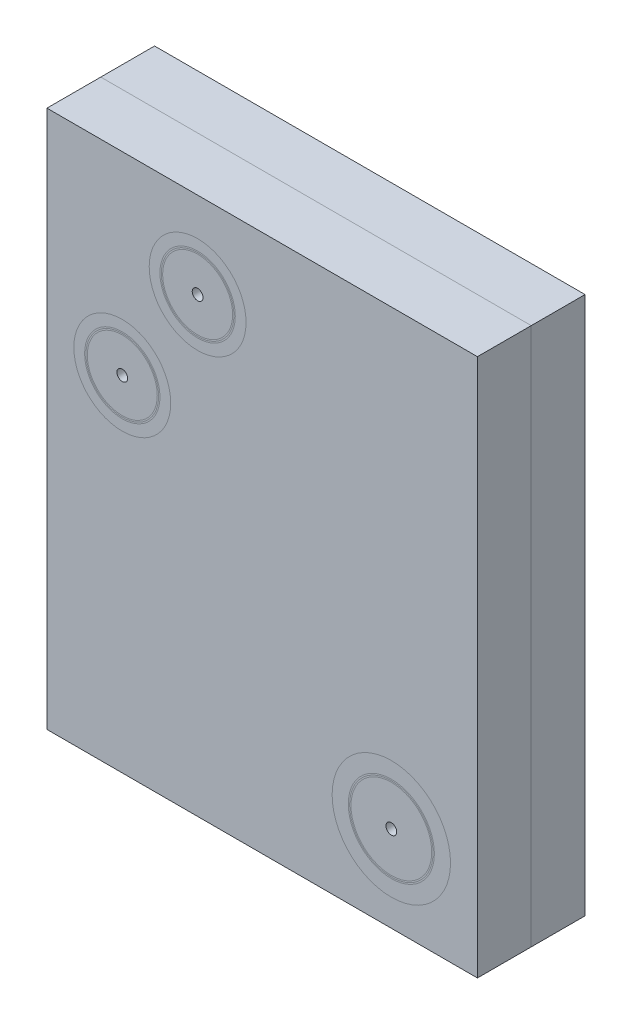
ISO-10303-21;
HEADER;
FILE_DESCRIPTION(('STEP AP214'),'2;1');
FILE_NAME('part.step','',(''),(''),'','','');
FILE_SCHEMA(('AUTOMOTIVE_DESIGN { 1 0 10303 214 1 1 1 1 }'));
ENDSEC;
DATA;
#1=APPLICATION_CONTEXT('core data for automotive mechanical design processes');
#2=APPLICATION_PROTOCOL_DEFINITION('international standard','automotive_design',2000,#1);
#3=PRODUCT_CONTEXT('',#1,'mechanical');
#4=PRODUCT('Part','Part','',(#3));
#5=PRODUCT_RELATED_PRODUCT_CATEGORY('part','',(#4));
#6=PRODUCT_DEFINITION_FORMATION('','',#4);
#7=PRODUCT_DEFINITION_CONTEXT('part definition',#1,'design');
#8=PRODUCT_DEFINITION('design','',#6,#7);
#9=PRODUCT_DEFINITION_SHAPE('','',#8);
#10=(LENGTH_UNIT() NAMED_UNIT(*) SI_UNIT(.MILLI.,.METRE.));
#11=(NAMED_UNIT(*) PLANE_ANGLE_UNIT() SI_UNIT($,.RADIAN.));
#12=(NAMED_UNIT(*) SI_UNIT($,.STERADIAN.) SOLID_ANGLE_UNIT());
#13=UNCERTAINTY_MEASURE_WITH_UNIT(LENGTH_MEASURE(1.E-05),#10,'distance_accuracy_value','');
#14=(GEOMETRIC_REPRESENTATION_CONTEXT(3) GLOBAL_UNCERTAINTY_ASSIGNED_CONTEXT((#13)) GLOBAL_UNIT_ASSIGNED_CONTEXT((#10,
#11,#12)) REPRESENTATION_CONTEXT('',''));
#15=CARTESIAN_POINT('',(0.,0.,0.));
#16=DIRECTION('',(0.,0.,1.));
#17=DIRECTION('',(1.,0.,0.));
#18=AXIS2_PLACEMENT_3D('',#15,#16,#17);
#19=CARTESIAN_POINT('',(32.,8.,-5.01));
#20=DIRECTION('',(0.,0.,1.));
#21=DIRECTION('',(1.,0.,0.));
#22=AXIS2_PLACEMENT_3D('',#19,#20,#21);
#23=CYLINDRICAL_SURFACE('',#22,3.75000000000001);
#24=CARTESIAN_POINT('',(32.,8.,-5.));
#25=DIRECTION('',(0.,0.,-1.));
#26=DIRECTION('',(-1.,0.,0.));
#27=AXIS2_PLACEMENT_3D('',#24,#25,#26);
#28=CIRCLE('',#27,3.75000000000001);
#29=CARTESIAN_POINT('',(28.25,8.,-5.));
#30=VERTEX_POINT('',#29);
#31=EDGE_CURVE('E66',#30,#30,#28,.T.);
#32=ORIENTED_EDGE('',*,*,#31,.F.);
#33=EDGE_LOOP('',(#32));
#34=FACE_BOUND('',#33,.T.);
#35=CARTESIAN_POINT('',(32.,8.,0.));
#36=DIRECTION('',(0.,0.,1.));
#37=DIRECTION('',(1.,0.,0.));
#38=AXIS2_PLACEMENT_3D('',#35,#36,#37);
#39=CIRCLE('',#38,3.75000000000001);
#40=CARTESIAN_POINT('',(35.75,8.,0.));
#41=VERTEX_POINT('',#40);
#42=EDGE_CURVE('E57',#41,#41,#39,.T.);
#43=ORIENTED_EDGE('',*,*,#42,.F.);
#44=EDGE_LOOP('',(#43));
#45=FACE_BOUND('',#44,.T.);
#46=ADVANCED_FACE('F53',(#34,#45),#23,.T.);
#47=CARTESIAN_POINT('',(32.,8.,-5.));
#48=DIRECTION('',(0.,0.,1.));
#49=DIRECTION('',(1.,0.,0.));
#50=AXIS2_PLACEMENT_3D('',#47,#48,#49);
#51=CYLINDRICAL_SURFACE('',#50,0.499999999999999);
#52=CARTESIAN_POINT('',(32.,8.,-5.));
#53=DIRECTION('',(0.,0.,1.));
#54=DIRECTION('',(1.,0.,0.));
#55=AXIS2_PLACEMENT_3D('',#52,#53,#54);
#56=CIRCLE('',#55,0.499999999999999);
#57=CARTESIAN_POINT('',(32.5,8.,-5.));
#58=VERTEX_POINT('',#57);
#59=EDGE_CURVE('E61',#58,#58,#56,.T.);
#60=ORIENTED_EDGE('',*,*,#59,.F.);
#61=EDGE_LOOP('',(#60));
#62=FACE_BOUND('',#61,.T.);
#63=CARTESIAN_POINT('',(32.,8.,0.));
#64=DIRECTION('',(0.,0.,1.));
#65=DIRECTION('',(1.,0.,0.));
#66=AXIS2_PLACEMENT_3D('',#63,#64,#65);
#67=CIRCLE('',#66,0.499999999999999);
#68=CARTESIAN_POINT('',(32.5,8.,0.));
#69=VERTEX_POINT('',#68);
#70=EDGE_CURVE('E12',#69,#69,#67,.F.);
#71=ORIENTED_EDGE('',*,*,#70,.F.);
#72=EDGE_LOOP('',(#71));
#73=FACE_BOUND('',#72,.T.);
#74=ADVANCED_FACE('F76',(#62,#73),#51,.F.);
#75=CARTESIAN_POINT('',(0.,0.,-5.));
#76=DIRECTION('',(0.,0.,-1.));
#77=DIRECTION('',(-1.,0.,0.));
#78=AXIS2_PLACEMENT_3D('',#75,#76,#77);
#79=PLANE('',#78);
#80=ORIENTED_EDGE('',*,*,#59,.T.);
#81=EDGE_LOOP('',(#80));
#82=FACE_BOUND('',#81,.T.);
#83=ORIENTED_EDGE('',*,*,#31,.T.);
#84=EDGE_LOOP('',(#83));
#85=FACE_BOUND('',#84,.T.);
#86=ADVANCED_FACE('F82',(#82,#85),#79,.T.);
#87=CARTESIAN_POINT('',(0.,0.,0.));
#88=DIRECTION('',(0.,0.,1.));
#89=DIRECTION('',(1.,0.,0.));
#90=AXIS2_PLACEMENT_3D('',#87,#88,#89);
#91=PLANE('',#90);
#92=ORIENTED_EDGE('',*,*,#70,.T.);
#93=EDGE_LOOP('',(#92));
#94=FACE_BOUND('',#93,.T.);
#95=ORIENTED_EDGE('',*,*,#42,.T.);
#96=EDGE_LOOP('',(#95));
#97=FACE_BOUND('',#96,.T.);
#98=ADVANCED_FACE('F55',(#94,#97),#91,.T.);
#99=CLOSED_SHELL('',(#46,#74,#86,#98));
#100=MANIFOLD_SOLID_BREP('B2',#99);
#101=CARTESIAN_POINT('',(14.,42.,-5.01));
#102=DIRECTION('',(0.,0.,1.));
#103=DIRECTION('',(1.,0.,0.));
#104=AXIS2_PLACEMENT_3D('',#101,#102,#103);
#105=CYLINDRICAL_SURFACE('',#104,3.25);
#106=CARTESIAN_POINT('',(14.,42.,0.));
#107=DIRECTION('',(0.,0.,1.));
#108=DIRECTION('',(1.,0.,0.));
#109=AXIS2_PLACEMENT_3D('',#106,#107,#108);
#110=CIRCLE('',#109,3.25);
#111=CARTESIAN_POINT('',(17.25,42.,0.));
#112=VERTEX_POINT('',#111);
#113=EDGE_CURVE('E126',#112,#112,#110,.T.);
#114=ORIENTED_EDGE('',*,*,#113,.F.);
#115=EDGE_LOOP('',(#114));
#116=FACE_BOUND('',#115,.T.);
#117=CARTESIAN_POINT('',(14.,42.,-5.));
#118=DIRECTION('',(0.,0.,-1.));
#119=DIRECTION('',(-1.,0.,0.));
#120=AXIS2_PLACEMENT_3D('',#117,#118,#119);
#121=CIRCLE('',#120,3.25);
#122=CARTESIAN_POINT('',(10.75,42.,-5.));
#123=VERTEX_POINT('',#122);
#124=EDGE_CURVE('E140',#123,#123,#121,.T.);
#125=ORIENTED_EDGE('',*,*,#124,.F.);
#126=EDGE_LOOP('',(#125));
#127=FACE_BOUND('',#126,.T.);
#128=ADVANCED_FACE('F122',(#116,#127),#105,.T.);
#129=CARTESIAN_POINT('',(14.,42.,-5.));
#130=DIRECTION('',(0.,0.,1.));
#131=DIRECTION('',(1.,0.,0.));
#132=AXIS2_PLACEMENT_3D('',#129,#130,#131);
#133=CYLINDRICAL_SURFACE('',#132,0.500000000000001);
#134=CARTESIAN_POINT('',(14.,42.,-5.));
#135=DIRECTION('',(0.,0.,1.));
#136=DIRECTION('',(1.,0.,0.));
#137=AXIS2_PLACEMENT_3D('',#134,#135,#136);
#138=CIRCLE('',#137,0.500000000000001);
#139=CARTESIAN_POINT('',(14.5,42.,-5.));
#140=VERTEX_POINT('',#139);
#141=EDGE_CURVE('E52',#140,#140,#138,.T.);
#142=ORIENTED_EDGE('',*,*,#141,.F.);
#143=EDGE_LOOP('',(#142));
#144=FACE_BOUND('',#143,.T.);
#145=CARTESIAN_POINT('',(14.,42.,0.));
#146=DIRECTION('',(0.,0.,1.));
#147=DIRECTION('',(1.,0.,0.));
#148=AXIS2_PLACEMENT_3D('',#145,#146,#147);
#149=CIRCLE('',#148,0.500000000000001);
#150=CARTESIAN_POINT('',(14.5,42.,0.));
#151=VERTEX_POINT('',#150);
#152=EDGE_CURVE('E132',#151,#151,#149,.F.);
#153=ORIENTED_EDGE('',*,*,#152,.F.);
#154=EDGE_LOOP('',(#153));
#155=FACE_BOUND('',#154,.T.);
#156=ADVANCED_FACE('F152',(#144,#155),#133,.F.);
#157=CARTESIAN_POINT('',(0.,0.,0.));
#158=DIRECTION('',(0.,0.,1.));
#159=DIRECTION('',(1.,0.,0.));
#160=AXIS2_PLACEMENT_3D('',#157,#158,#159);
#161=PLANE('',#160);
#162=ORIENTED_EDGE('',*,*,#152,.T.);
#163=EDGE_LOOP('',(#162));
#164=FACE_BOUND('',#163,.T.);
#165=ORIENTED_EDGE('',*,*,#113,.T.);
#166=EDGE_LOOP('',(#165));
#167=FACE_BOUND('',#166,.T.);
#168=ADVANCED_FACE('F148',(#164,#167),#161,.T.);
#169=CARTESIAN_POINT('',(0.,0.,-5.));
#170=DIRECTION('',(0.,0.,-1.));
#171=DIRECTION('',(-1.,0.,0.));
#172=AXIS2_PLACEMENT_3D('',#169,#170,#171);
#173=PLANE('',#172);
#174=ORIENTED_EDGE('',*,*,#141,.T.);
#175=EDGE_LOOP('',(#174));
#176=FACE_BOUND('',#175,.T.);
#177=ORIENTED_EDGE('',*,*,#124,.T.);
#178=EDGE_LOOP('',(#177));
#179=FACE_BOUND('',#178,.T.);
#180=ADVANCED_FACE('F124',(#176,#179),#173,.T.);
#181=CLOSED_SHELL('',(#128,#156,#168,#180));
#182=MANIFOLD_SOLID_BREP('B7',#181);
#183=CARTESIAN_POINT('',(14.,42.,-5.01));
#184=DIRECTION('',(0.,0.,1.));
#185=DIRECTION('',(1.,0.,0.));
#186=AXIS2_PLACEMENT_3D('',#183,#184,#185);
#187=CYLINDRICAL_SURFACE('',#186,3.25);
#188=CARTESIAN_POINT('',(14.,42.,-5.));
#189=DIRECTION('',(0.,0.,-1.));
#190=DIRECTION('',(-1.,0.,0.));
#191=AXIS2_PLACEMENT_3D('',#188,#189,#190);
#192=CIRCLE('',#191,3.25);
#193=CARTESIAN_POINT('',(10.75,42.,-5.));
#194=VERTEX_POINT('',#193);
#195=EDGE_CURVE('E216',#194,#194,#192,.T.);
#196=ORIENTED_EDGE('',*,*,#195,.T.);
#197=EDGE_LOOP('',(#196));
#198=FACE_BOUND('',#197,.T.);
#199=CARTESIAN_POINT('',(14.,42.,0.));
#200=DIRECTION('',(0.,0.,1.));
#201=DIRECTION('',(1.,0.,0.));
#202=AXIS2_PLACEMENT_3D('',#199,#200,#201);
#203=CIRCLE('',#202,3.25);
#204=CARTESIAN_POINT('',(17.25,42.,0.));
#205=VERTEX_POINT('',#204);
#206=EDGE_CURVE('E204',#205,#205,#203,.T.);
#207=ORIENTED_EDGE('',*,*,#206,.T.);
#208=EDGE_LOOP('',(#207));
#209=FACE_BOUND('',#208,.T.);
#210=ADVANCED_FACE('F200',(#198,#209),#187,.F.);
#211=CARTESIAN_POINT('',(14.,42.,-5.01));
#212=DIRECTION('',(0.,0.,1.));
#213=DIRECTION('',(1.,0.,0.));
#214=AXIS2_PLACEMENT_3D('',#211,#212,#213);
#215=CYLINDRICAL_SURFACE('',#214,3.375);
#216=CARTESIAN_POINT('',(14.,42.,0.));
#217=DIRECTION('',(0.,0.,1.));
#218=DIRECTION('',(1.,0.,0.));
#219=AXIS2_PLACEMENT_3D('',#216,#217,#218);
#220=CIRCLE('',#219,3.375);
#221=CARTESIAN_POINT('',(17.375,42.,0.));
#222=VERTEX_POINT('',#221);
#223=EDGE_CURVE('E121',#222,#222,#220,.T.);
#224=ORIENTED_EDGE('',*,*,#223,.F.);
#225=EDGE_LOOP('',(#224));
#226=FACE_BOUND('',#225,.T.);
#227=CARTESIAN_POINT('',(14.,42.,-5.));
#228=DIRECTION('',(0.,0.,-1.));
#229=DIRECTION('',(-1.,0.,0.));
#230=AXIS2_PLACEMENT_3D('',#227,#228,#229);
#231=CIRCLE('',#230,3.375);
#232=CARTESIAN_POINT('',(10.625,42.,-5.));
#233=VERTEX_POINT('',#232);
#234=EDGE_CURVE('E209',#233,#233,#231,.T.);
#235=ORIENTED_EDGE('',*,*,#234,.F.);
#236=EDGE_LOOP('',(#235));
#237=FACE_BOUND('',#236,.T.);
#238=ADVANCED_FACE('F228',(#226,#237),#215,.T.);
#239=CARTESIAN_POINT('',(0.,0.,0.));
#240=DIRECTION('',(0.,0.,1.));
#241=DIRECTION('',(1.,0.,0.));
#242=AXIS2_PLACEMENT_3D('',#239,#240,#241);
#243=PLANE('',#242);
#244=ORIENTED_EDGE('',*,*,#206,.F.);
#245=EDGE_LOOP('',(#244));
#246=FACE_BOUND('',#245,.T.);
#247=ORIENTED_EDGE('',*,*,#223,.T.);
#248=EDGE_LOOP('',(#247));
#249=FACE_BOUND('',#248,.T.);
#250=ADVANCED_FACE('F226',(#246,#249),#243,.T.);
#251=CARTESIAN_POINT('',(0.,0.,-5.));
#252=DIRECTION('',(0.,0.,-1.));
#253=DIRECTION('',(-1.,0.,0.));
#254=AXIS2_PLACEMENT_3D('',#251,#252,#253);
#255=PLANE('',#254);
#256=ORIENTED_EDGE('',*,*,#195,.F.);
#257=EDGE_LOOP('',(#256));
#258=FACE_BOUND('',#257,.T.);
#259=ORIENTED_EDGE('',*,*,#234,.T.);
#260=EDGE_LOOP('',(#259));
#261=FACE_BOUND('',#260,.T.);
#262=ADVANCED_FACE('F202',(#258,#261),#255,.T.);
#263=CLOSED_SHELL('',(#210,#238,#250,#262));
#264=MANIFOLD_SOLID_BREP('B47',#263);
#265=CARTESIAN_POINT('',(7.,32.,-5.01));
#266=DIRECTION('',(0.,0.,1.));
#267=DIRECTION('',(1.,0.,0.));
#268=AXIS2_PLACEMENT_3D('',#265,#266,#267);
#269=CYLINDRICAL_SURFACE('',#268,3.25);
#270=CARTESIAN_POINT('',(7.,32.,0.));
#271=DIRECTION('',(0.,0.,1.));
#272=DIRECTION('',(1.,0.,0.));
#273=AXIS2_PLACEMENT_3D('',#270,#271,#272);
#274=CIRCLE('',#273,3.25);
#275=CARTESIAN_POINT('',(10.25,32.,0.));
#276=VERTEX_POINT('',#275);
#277=EDGE_CURVE('E279',#276,#276,#274,.T.);
#278=ORIENTED_EDGE('',*,*,#277,.F.);
#279=EDGE_LOOP('',(#278));
#280=FACE_BOUND('',#279,.T.);
#281=CARTESIAN_POINT('',(7.,32.,-5.));
#282=DIRECTION('',(0.,0.,-1.));
#283=DIRECTION('',(-1.,0.,0.));
#284=AXIS2_PLACEMENT_3D('',#281,#282,#283);
#285=CIRCLE('',#284,3.25);
#286=CARTESIAN_POINT('',(3.75,32.,-5.));
#287=VERTEX_POINT('',#286);
#288=EDGE_CURVE('E291',#287,#287,#285,.T.);
#289=ORIENTED_EDGE('',*,*,#288,.F.);
#290=EDGE_LOOP('',(#289));
#291=FACE_BOUND('',#290,.T.);
#292=ADVANCED_FACE('F275',(#280,#291),#269,.T.);
#293=CARTESIAN_POINT('',(7.,32.,-5.));
#294=DIRECTION('',(0.,0.,1.));
#295=DIRECTION('',(1.,0.,0.));
#296=AXIS2_PLACEMENT_3D('',#293,#294,#295);
#297=CYLINDRICAL_SURFACE('',#296,0.5);
#298=CARTESIAN_POINT('',(7.,32.,-5.));
#299=DIRECTION('',(0.,0.,1.));
#300=DIRECTION('',(1.,0.,0.));
#301=AXIS2_PLACEMENT_3D('',#298,#299,#300);
#302=CIRCLE('',#301,0.5);
#303=CARTESIAN_POINT('',(7.5,32.,-5.));
#304=VERTEX_POINT('',#303);
#305=EDGE_CURVE('E199',#304,#304,#302,.T.);
#306=ORIENTED_EDGE('',*,*,#305,.F.);
#307=EDGE_LOOP('',(#306));
#308=FACE_BOUND('',#307,.T.);
#309=CARTESIAN_POINT('',(7.,32.,0.));
#310=DIRECTION('',(0.,0.,1.));
#311=DIRECTION('',(1.,0.,0.));
#312=AXIS2_PLACEMENT_3D('',#309,#310,#311);
#313=CIRCLE('',#312,0.5);
#314=CARTESIAN_POINT('',(7.5,32.,0.));
#315=VERTEX_POINT('',#314);
#316=EDGE_CURVE('E284',#315,#315,#313,.F.);
#317=ORIENTED_EDGE('',*,*,#316,.F.);
#318=EDGE_LOOP('',(#317));
#319=FACE_BOUND('',#318,.T.);
#320=ADVANCED_FACE('F304',(#308,#319),#297,.F.);
#321=CARTESIAN_POINT('',(0.,0.,0.));
#322=DIRECTION('',(0.,0.,1.));
#323=DIRECTION('',(1.,0.,0.));
#324=AXIS2_PLACEMENT_3D('',#321,#322,#323);
#325=PLANE('',#324);
#326=ORIENTED_EDGE('',*,*,#316,.T.);
#327=EDGE_LOOP('',(#326));
#328=FACE_BOUND('',#327,.T.);
#329=ORIENTED_EDGE('',*,*,#277,.T.);
#330=EDGE_LOOP('',(#329));
#331=FACE_BOUND('',#330,.T.);
#332=ADVANCED_FACE('F300',(#328,#331),#325,.T.);
#333=CARTESIAN_POINT('',(0.,0.,-5.));
#334=DIRECTION('',(0.,0.,-1.));
#335=DIRECTION('',(-1.,0.,0.));
#336=AXIS2_PLACEMENT_3D('',#333,#334,#335);
#337=PLANE('',#336);
#338=ORIENTED_EDGE('',*,*,#305,.T.);
#339=EDGE_LOOP('',(#338));
#340=FACE_BOUND('',#339,.T.);
#341=ORIENTED_EDGE('',*,*,#288,.T.);
#342=EDGE_LOOP('',(#341));
#343=FACE_BOUND('',#342,.T.);
#344=ADVANCED_FACE('F277',(#340,#343),#337,.T.);
#345=CLOSED_SHELL('',(#292,#320,#332,#344));
#346=MANIFOLD_SOLID_BREP('B116',#345);
#347=CARTESIAN_POINT('',(14.,42.,-5.01));
#348=DIRECTION('',(0.,0.,1.));
#349=DIRECTION('',(1.,0.,0.));
#350=AXIS2_PLACEMENT_3D('',#347,#348,#349);
#351=CYLINDRICAL_SURFACE('',#350,3.375);
#352=CARTESIAN_POINT('',(14.,42.,-5.));
#353=DIRECTION('',(0.,0.,-1.));
#354=DIRECTION('',(-1.,0.,0.));
#355=AXIS2_PLACEMENT_3D('',#352,#353,#354);
#356=CIRCLE('',#355,3.375);
#357=CARTESIAN_POINT('',(10.625,42.,-5.));
#358=VERTEX_POINT('',#357);
#359=EDGE_CURVE('E368',#358,#358,#356,.T.);
#360=ORIENTED_EDGE('',*,*,#359,.T.);
#361=EDGE_LOOP('',(#360));
#362=FACE_BOUND('',#361,.T.);
#363=CARTESIAN_POINT('',(14.,42.,0.));
#364=DIRECTION('',(0.,0.,1.));
#365=DIRECTION('',(1.,0.,0.));
#366=AXIS2_PLACEMENT_3D('',#363,#364,#365);
#367=CIRCLE('',#366,3.375);
#368=CARTESIAN_POINT('',(17.375,42.,0.));
#369=VERTEX_POINT('',#368);
#370=EDGE_CURVE('E356',#369,#369,#367,.T.);
#371=ORIENTED_EDGE('',*,*,#370,.T.);
#372=EDGE_LOOP('',(#371));
#373=FACE_BOUND('',#372,.T.);
#374=ADVANCED_FACE('F352',(#362,#373),#351,.F.);
#375=CARTESIAN_POINT('',(14.,42.,-5.01));
#376=DIRECTION('',(0.,0.,1.));
#377=DIRECTION('',(1.,0.,0.));
#378=AXIS2_PLACEMENT_3D('',#375,#376,#377);
#379=CYLINDRICAL_SURFACE('',#378,3.5);
#380=CARTESIAN_POINT('',(14.,42.,0.));
#381=DIRECTION('',(0.,0.,1.));
#382=DIRECTION('',(1.,0.,0.));
#383=AXIS2_PLACEMENT_3D('',#380,#381,#382);
#384=CIRCLE('',#383,3.5);
#385=CARTESIAN_POINT('',(17.5,42.,0.));
#386=VERTEX_POINT('',#385);
#387=EDGE_CURVE('E274',#386,#386,#384,.T.);
#388=ORIENTED_EDGE('',*,*,#387,.F.);
#389=EDGE_LOOP('',(#388));
#390=FACE_BOUND('',#389,.T.);
#391=CARTESIAN_POINT('',(14.,42.,-5.));
#392=DIRECTION('',(0.,0.,-1.));
#393=DIRECTION('',(-1.,0.,0.));
#394=AXIS2_PLACEMENT_3D('',#391,#392,#393);
#395=CIRCLE('',#394,3.5);
#396=CARTESIAN_POINT('',(10.5,42.,-5.));
#397=VERTEX_POINT('',#396);
#398=EDGE_CURVE('E361',#397,#397,#395,.T.);
#399=ORIENTED_EDGE('',*,*,#398,.F.);
#400=EDGE_LOOP('',(#399));
#401=FACE_BOUND('',#400,.T.);
#402=ADVANCED_FACE('F380',(#390,#401),#379,.T.);
#403=CARTESIAN_POINT('',(0.,0.,0.));
#404=DIRECTION('',(0.,0.,1.));
#405=DIRECTION('',(1.,0.,0.));
#406=AXIS2_PLACEMENT_3D('',#403,#404,#405);
#407=PLANE('',#406);
#408=ORIENTED_EDGE('',*,*,#370,.F.);
#409=EDGE_LOOP('',(#408));
#410=FACE_BOUND('',#409,.T.);
#411=ORIENTED_EDGE('',*,*,#387,.T.);
#412=EDGE_LOOP('',(#411));
#413=FACE_BOUND('',#412,.T.);
#414=ADVANCED_FACE('F378',(#410,#413),#407,.T.);
#415=CARTESIAN_POINT('',(0.,0.,-5.));
#416=DIRECTION('',(0.,0.,-1.));
#417=DIRECTION('',(-1.,0.,0.));
#418=AXIS2_PLACEMENT_3D('',#415,#416,#417);
#419=PLANE('',#418);
#420=ORIENTED_EDGE('',*,*,#359,.F.);
#421=EDGE_LOOP('',(#420));
#422=FACE_BOUND('',#421,.T.);
#423=ORIENTED_EDGE('',*,*,#398,.T.);
#424=EDGE_LOOP('',(#423));
#425=FACE_BOUND('',#424,.T.);
#426=ADVANCED_FACE('F354',(#422,#425),#419,.T.);
#427=CLOSED_SHELL('',(#374,#402,#414,#426));
#428=MANIFOLD_SOLID_BREP('B194',#427);
#429=CARTESIAN_POINT('',(14.,42.,-5.01));
#430=DIRECTION('',(0.,0.,1.));
#431=DIRECTION('',(1.,0.,0.));
#432=AXIS2_PLACEMENT_3D('',#429,#430,#431);
#433=CYLINDRICAL_SURFACE('',#432,3.5);
#434=CARTESIAN_POINT('',(14.,42.,-5.));
#435=DIRECTION('',(0.,0.,-1.));
#436=DIRECTION('',(-1.,0.,0.));
#437=AXIS2_PLACEMENT_3D('',#434,#435,#436);
#438=CIRCLE('',#437,3.5);
#439=CARTESIAN_POINT('',(10.5,42.,-5.));
#440=VERTEX_POINT('',#439);
#441=EDGE_CURVE('E444',#440,#440,#438,.T.);
#442=ORIENTED_EDGE('',*,*,#441,.T.);
#443=EDGE_LOOP('',(#442));
#444=FACE_BOUND('',#443,.T.);
#445=CARTESIAN_POINT('',(14.,42.,0.));
#446=DIRECTION('',(0.,0.,1.));
#447=DIRECTION('',(1.,0.,0.));
#448=AXIS2_PLACEMENT_3D('',#445,#446,#447);
#449=CIRCLE('',#448,3.5);
#450=CARTESIAN_POINT('',(17.5,42.,0.));
#451=VERTEX_POINT('',#450);
#452=EDGE_CURVE('E432',#451,#451,#449,.T.);
#453=ORIENTED_EDGE('',*,*,#452,.T.);
#454=EDGE_LOOP('',(#453));
#455=FACE_BOUND('',#454,.T.);
#456=ADVANCED_FACE('F428',(#444,#455),#433,.F.);
#457=CARTESIAN_POINT('',(14.,42.,-5.01));
#458=DIRECTION('',(0.,0.,1.));
#459=DIRECTION('',(1.,0.,0.));
#460=AXIS2_PLACEMENT_3D('',#457,#458,#459);
#461=CYLINDRICAL_SURFACE('',#460,4.5);
#462=CARTESIAN_POINT('',(14.,42.,0.));
#463=DIRECTION('',(0.,0.,1.));
#464=DIRECTION('',(1.,0.,0.));
#465=AXIS2_PLACEMENT_3D('',#462,#463,#464);
#466=CIRCLE('',#465,4.5);
#467=CARTESIAN_POINT('',(18.5,42.,0.));
#468=VERTEX_POINT('',#467);
#469=EDGE_CURVE('E351',#468,#468,#466,.T.);
#470=ORIENTED_EDGE('',*,*,#469,.F.);
#471=EDGE_LOOP('',(#470));
#472=FACE_BOUND('',#471,.T.);
#473=CARTESIAN_POINT('',(14.,42.,-5.));
#474=DIRECTION('',(0.,0.,-1.));
#475=DIRECTION('',(-1.,0.,0.));
#476=AXIS2_PLACEMENT_3D('',#473,#474,#475);
#477=CIRCLE('',#476,4.5);
#478=CARTESIAN_POINT('',(9.5,42.,-5.));
#479=VERTEX_POINT('',#478);
#480=EDGE_CURVE('E437',#479,#479,#477,.T.);
#481=ORIENTED_EDGE('',*,*,#480,.F.);
#482=EDGE_LOOP('',(#481));
#483=FACE_BOUND('',#482,.T.);
#484=ADVANCED_FACE('F456',(#472,#483),#461,.T.);
#485=CARTESIAN_POINT('',(0.,0.,0.));
#486=DIRECTION('',(0.,0.,1.));
#487=DIRECTION('',(1.,0.,0.));
#488=AXIS2_PLACEMENT_3D('',#485,#486,#487);
#489=PLANE('',#488);
#490=ORIENTED_EDGE('',*,*,#452,.F.);
#491=EDGE_LOOP('',(#490));
#492=FACE_BOUND('',#491,.T.);
#493=ORIENTED_EDGE('',*,*,#469,.T.);
#494=EDGE_LOOP('',(#493));
#495=FACE_BOUND('',#494,.T.);
#496=ADVANCED_FACE('F454',(#492,#495),#489,.T.);
#497=CARTESIAN_POINT('',(0.,0.,-5.));
#498=DIRECTION('',(0.,0.,-1.));
#499=DIRECTION('',(-1.,0.,0.));
#500=AXIS2_PLACEMENT_3D('',#497,#498,#499);
#501=PLANE('',#500);
#502=ORIENTED_EDGE('',*,*,#441,.F.);
#503=EDGE_LOOP('',(#502));
#504=FACE_BOUND('',#503,.T.);
#505=ORIENTED_EDGE('',*,*,#480,.T.);
#506=EDGE_LOOP('',(#505));
#507=FACE_BOUND('',#506,.T.);
#508=ADVANCED_FACE('F430',(#504,#507),#501,.T.);
#509=CLOSED_SHELL('',(#456,#484,#496,#508));
#510=MANIFOLD_SOLID_BREP('B269',#509);
#511=CARTESIAN_POINT('',(7.,32.,-5.01));
#512=DIRECTION('',(0.,0.,1.));
#513=DIRECTION('',(1.,0.,0.));
#514=AXIS2_PLACEMENT_3D('',#511,#512,#513);
#515=CYLINDRICAL_SURFACE('',#514,3.25);
#516=CARTESIAN_POINT('',(7.,32.,-5.));
#517=DIRECTION('',(0.,0.,-1.));
#518=DIRECTION('',(-1.,0.,0.));
#519=AXIS2_PLACEMENT_3D('',#516,#517,#518);
#520=CIRCLE('',#519,3.25);
#521=CARTESIAN_POINT('',(3.75,32.,-5.));
#522=VERTEX_POINT('',#521);
#523=EDGE_CURVE('E520',#522,#522,#520,.T.);
#524=ORIENTED_EDGE('',*,*,#523,.T.);
#525=EDGE_LOOP('',(#524));
#526=FACE_BOUND('',#525,.T.);
#527=CARTESIAN_POINT('',(7.,32.,0.));
#528=DIRECTION('',(0.,0.,1.));
#529=DIRECTION('',(1.,0.,0.));
#530=AXIS2_PLACEMENT_3D('',#527,#528,#529);
#531=CIRCLE('',#530,3.25);
#532=CARTESIAN_POINT('',(10.25,32.,0.));
#533=VERTEX_POINT('',#532);
#534=EDGE_CURVE('E508',#533,#533,#531,.T.);
#535=ORIENTED_EDGE('',*,*,#534,.T.);
#536=EDGE_LOOP('',(#535));
#537=FACE_BOUND('',#536,.T.);
#538=ADVANCED_FACE('F504',(#526,#537),#515,.F.);
#539=CARTESIAN_POINT('',(7.,32.,-5.01));
#540=DIRECTION('',(0.,0.,1.));
#541=DIRECTION('',(1.,0.,0.));
#542=AXIS2_PLACEMENT_3D('',#539,#540,#541);
#543=CYLINDRICAL_SURFACE('',#542,3.375);
#544=CARTESIAN_POINT('',(7.,32.,0.));
#545=DIRECTION('',(0.,0.,1.));
#546=DIRECTION('',(1.,0.,0.));
#547=AXIS2_PLACEMENT_3D('',#544,#545,#546);
#548=CIRCLE('',#547,3.375);
#549=CARTESIAN_POINT('',(10.375,32.,0.));
#550=VERTEX_POINT('',#549);
#551=EDGE_CURVE('E427',#550,#550,#548,.T.);
#552=ORIENTED_EDGE('',*,*,#551,.F.);
#553=EDGE_LOOP('',(#552));
#554=FACE_BOUND('',#553,.T.);
#555=CARTESIAN_POINT('',(7.,32.,-5.));
#556=DIRECTION('',(0.,0.,-1.));
#557=DIRECTION('',(-1.,0.,0.));
#558=AXIS2_PLACEMENT_3D('',#555,#556,#557);
#559=CIRCLE('',#558,3.375);
#560=CARTESIAN_POINT('',(3.625,32.,-5.));
#561=VERTEX_POINT('',#560);
#562=EDGE_CURVE('E513',#561,#561,#559,.T.);
#563=ORIENTED_EDGE('',*,*,#562,.F.);
#564=EDGE_LOOP('',(#563));
#565=FACE_BOUND('',#564,.T.);
#566=ADVANCED_FACE('F532',(#554,#565),#543,.T.);
#567=CARTESIAN_POINT('',(0.,0.,0.));
#568=DIRECTION('',(0.,0.,1.));
#569=DIRECTION('',(1.,0.,0.));
#570=AXIS2_PLACEMENT_3D('',#567,#568,#569);
#571=PLANE('',#570);
#572=ORIENTED_EDGE('',*,*,#534,.F.);
#573=EDGE_LOOP('',(#572));
#574=FACE_BOUND('',#573,.T.);
#575=ORIENTED_EDGE('',*,*,#551,.T.);
#576=EDGE_LOOP('',(#575));
#577=FACE_BOUND('',#576,.T.);
#578=ADVANCED_FACE('F530',(#574,#577),#571,.T.);
#579=CARTESIAN_POINT('',(0.,0.,-5.));
#580=DIRECTION('',(0.,0.,-1.));
#581=DIRECTION('',(-1.,0.,0.));
#582=AXIS2_PLACEMENT_3D('',#579,#580,#581);
#583=PLANE('',#582);
#584=ORIENTED_EDGE('',*,*,#523,.F.);
#585=EDGE_LOOP('',(#584));
#586=FACE_BOUND('',#585,.T.);
#587=ORIENTED_EDGE('',*,*,#562,.T.);
#588=EDGE_LOOP('',(#587));
#589=FACE_BOUND('',#588,.T.);
#590=ADVANCED_FACE('F506',(#586,#589),#583,.T.);
#591=CLOSED_SHELL('',(#538,#566,#578,#590));
#592=MANIFOLD_SOLID_BREP('B346',#591);
#593=CARTESIAN_POINT('',(7.,32.,-5.01));
#594=DIRECTION('',(0.,0.,1.));
#595=DIRECTION('',(1.,0.,0.));
#596=AXIS2_PLACEMENT_3D('',#593,#594,#595);
#597=CYLINDRICAL_SURFACE('',#596,3.375);
#598=CARTESIAN_POINT('',(7.,32.,-5.));
#599=DIRECTION('',(0.,0.,-1.));
#600=DIRECTION('',(-1.,0.,0.));
#601=AXIS2_PLACEMENT_3D('',#598,#599,#600);
#602=CIRCLE('',#601,3.375);
#603=CARTESIAN_POINT('',(3.625,32.,-5.));
#604=VERTEX_POINT('',#603);
#605=EDGE_CURVE('E595',#604,#604,#602,.T.);
#606=ORIENTED_EDGE('',*,*,#605,.T.);
#607=EDGE_LOOP('',(#606));
#608=FACE_BOUND('',#607,.T.);
#609=CARTESIAN_POINT('',(7.,32.,0.));
#610=DIRECTION('',(0.,0.,1.));
#611=DIRECTION('',(1.,0.,0.));
#612=AXIS2_PLACEMENT_3D('',#609,#610,#611);
#613=CIRCLE('',#612,3.375);
#614=CARTESIAN_POINT('',(10.375,32.,0.));
#615=VERTEX_POINT('',#614);
#616=EDGE_CURVE('E583',#615,#615,#613,.T.);
#617=ORIENTED_EDGE('',*,*,#616,.T.);
#618=EDGE_LOOP('',(#617));
#619=FACE_BOUND('',#618,.T.);
#620=ADVANCED_FACE('F579',(#608,#619),#597,.F.);
#621=CARTESIAN_POINT('',(7.,32.,-5.01));
#622=DIRECTION('',(0.,0.,1.));
#623=DIRECTION('',(1.,0.,0.));
#624=AXIS2_PLACEMENT_3D('',#621,#622,#623);
#625=CYLINDRICAL_SURFACE('',#624,3.5);
#626=CARTESIAN_POINT('',(7.,32.,0.));
#627=DIRECTION('',(0.,0.,1.));
#628=DIRECTION('',(1.,0.,0.));
#629=AXIS2_PLACEMENT_3D('',#626,#627,#628);
#630=CIRCLE('',#629,3.5);
#631=CARTESIAN_POINT('',(10.5,32.,0.));
#632=VERTEX_POINT('',#631);
#633=EDGE_CURVE('E503',#632,#632,#630,.T.);
#634=ORIENTED_EDGE('',*,*,#633,.F.);
#635=EDGE_LOOP('',(#634));
#636=FACE_BOUND('',#635,.T.);
#637=CARTESIAN_POINT('',(7.,32.,-5.));
#638=DIRECTION('',(0.,0.,-1.));
#639=DIRECTION('',(-1.,0.,0.));
#640=AXIS2_PLACEMENT_3D('',#637,#638,#639);
#641=CIRCLE('',#640,3.5);
#642=CARTESIAN_POINT('',(3.5,32.,-5.));
#643=VERTEX_POINT('',#642);
#644=EDGE_CURVE('E588',#643,#643,#641,.T.);
#645=ORIENTED_EDGE('',*,*,#644,.F.);
#646=EDGE_LOOP('',(#645));
#647=FACE_BOUND('',#646,.T.);
#648=ADVANCED_FACE('F607',(#636,#647),#625,.T.);
#649=CARTESIAN_POINT('',(0.,0.,0.));
#650=DIRECTION('',(0.,0.,1.));
#651=DIRECTION('',(1.,0.,0.));
#652=AXIS2_PLACEMENT_3D('',#649,#650,#651);
#653=PLANE('',#652);
#654=ORIENTED_EDGE('',*,*,#616,.F.);
#655=EDGE_LOOP('',(#654));
#656=FACE_BOUND('',#655,.T.);
#657=ORIENTED_EDGE('',*,*,#633,.T.);
#658=EDGE_LOOP('',(#657));
#659=FACE_BOUND('',#658,.T.);
#660=ADVANCED_FACE('F605',(#656,#659),#653,.T.);
#661=CARTESIAN_POINT('',(0.,0.,-5.));
#662=DIRECTION('',(0.,0.,-1.));
#663=DIRECTION('',(-1.,0.,0.));
#664=AXIS2_PLACEMENT_3D('',#661,#662,#663);
#665=PLANE('',#664);
#666=ORIENTED_EDGE('',*,*,#605,.F.);
#667=EDGE_LOOP('',(#666));
#668=FACE_BOUND('',#667,.T.);
#669=ORIENTED_EDGE('',*,*,#644,.T.);
#670=EDGE_LOOP('',(#669));
#671=FACE_BOUND('',#670,.T.);
#672=ADVANCED_FACE('F581',(#668,#671),#665,.T.);
#673=CLOSED_SHELL('',(#620,#648,#660,#672));
#674=MANIFOLD_SOLID_BREP('B422',#673);
#675=CARTESIAN_POINT('',(7.,32.,-5.01));
#676=DIRECTION('',(0.,0.,1.));
#677=DIRECTION('',(1.,0.,0.));
#678=AXIS2_PLACEMENT_3D('',#675,#676,#677);
#679=CYLINDRICAL_SURFACE('',#678,3.5);
#680=CARTESIAN_POINT('',(7.,32.,-5.));
#681=DIRECTION('',(0.,0.,-1.));
#682=DIRECTION('',(-1.,0.,0.));
#683=AXIS2_PLACEMENT_3D('',#680,#681,#682);
#684=CIRCLE('',#683,3.5);
#685=CARTESIAN_POINT('',(3.5,32.,-5.));
#686=VERTEX_POINT('',#685);
#687=EDGE_CURVE('E674',#686,#686,#684,.T.);
#688=ORIENTED_EDGE('',*,*,#687,.T.);
#689=EDGE_LOOP('',(#688));
#690=FACE_BOUND('',#689,.T.);
#691=CARTESIAN_POINT('',(7.,32.,0.));
#692=DIRECTION('',(0.,0.,1.));
#693=DIRECTION('',(1.,0.,0.));
#694=AXIS2_PLACEMENT_3D('',#691,#692,#693);
#695=CIRCLE('',#694,3.5);
#696=CARTESIAN_POINT('',(10.5,32.,0.));
#697=VERTEX_POINT('',#696);
#698=EDGE_CURVE('E662',#697,#697,#695,.T.);
#699=ORIENTED_EDGE('',*,*,#698,.T.);
#700=EDGE_LOOP('',(#699));
#701=FACE_BOUND('',#700,.T.);
#702=ADVANCED_FACE('F658',(#690,#701),#679,.F.);
#703=CARTESIAN_POINT('',(7.,32.,-5.01));
#704=DIRECTION('',(0.,0.,1.));
#705=DIRECTION('',(1.,0.,0.));
#706=AXIS2_PLACEMENT_3D('',#703,#704,#705);
#707=CYLINDRICAL_SURFACE('',#706,4.5);
#708=CARTESIAN_POINT('',(7.,32.,0.));
#709=DIRECTION('',(0.,0.,1.));
#710=DIRECTION('',(1.,0.,0.));
#711=AXIS2_PLACEMENT_3D('',#708,#709,#710);
#712=CIRCLE('',#711,4.5);
#713=CARTESIAN_POINT('',(11.5,32.,0.));
#714=VERTEX_POINT('',#713);
#715=EDGE_CURVE('E578',#714,#714,#712,.T.);
#716=ORIENTED_EDGE('',*,*,#715,.F.);
#717=EDGE_LOOP('',(#716));
#718=FACE_BOUND('',#717,.T.);
#719=CARTESIAN_POINT('',(7.,32.,-5.));
#720=DIRECTION('',(0.,0.,-1.));
#721=DIRECTION('',(-1.,0.,0.));
#722=AXIS2_PLACEMENT_3D('',#719,#720,#721);
#723=CIRCLE('',#722,4.5);
#724=CARTESIAN_POINT('',(2.5,32.,-5.));
#725=VERTEX_POINT('',#724);
#726=EDGE_CURVE('E667',#725,#725,#723,.T.);
#727=ORIENTED_EDGE('',*,*,#726,.F.);
#728=EDGE_LOOP('',(#727));
#729=FACE_BOUND('',#728,.T.);
#730=ADVANCED_FACE('F686',(#718,#729),#707,.T.);
#731=CARTESIAN_POINT('',(0.,0.,0.));
#732=DIRECTION('',(0.,0.,1.));
#733=DIRECTION('',(1.,0.,0.));
#734=AXIS2_PLACEMENT_3D('',#731,#732,#733);
#735=PLANE('',#734);
#736=ORIENTED_EDGE('',*,*,#698,.F.);
#737=EDGE_LOOP('',(#736));
#738=FACE_BOUND('',#737,.T.);
#739=ORIENTED_EDGE('',*,*,#715,.T.);
#740=EDGE_LOOP('',(#739));
#741=FACE_BOUND('',#740,.T.);
#742=ADVANCED_FACE('F684',(#738,#741),#735,.T.);
#743=CARTESIAN_POINT('',(0.,0.,-5.));
#744=DIRECTION('',(0.,0.,-1.));
#745=DIRECTION('',(-1.,0.,0.));
#746=AXIS2_PLACEMENT_3D('',#743,#744,#745);
#747=PLANE('',#746);
#748=ORIENTED_EDGE('',*,*,#687,.F.);
#749=EDGE_LOOP('',(#748));
#750=FACE_BOUND('',#749,.T.);
#751=ORIENTED_EDGE('',*,*,#726,.T.);
#752=EDGE_LOOP('',(#751));
#753=FACE_BOUND('',#752,.T.);
#754=ADVANCED_FACE('F660',(#750,#753),#747,.T.);
#755=CLOSED_SHELL('',(#702,#730,#742,#754));
#756=MANIFOLD_SOLID_BREP('B498',#755);
#757=CARTESIAN_POINT('',(14.,42.,-5.01));
#758=DIRECTION('',(0.,0.,1.));
#759=DIRECTION('',(1.,0.,0.));
#760=AXIS2_PLACEMENT_3D('',#757,#758,#759);
#761=CYLINDRICAL_SURFACE('',#760,4.5);
#762=CARTESIAN_POINT('',(14.,42.,-5.));
#763=DIRECTION('',(0.,0.,-1.));
#764=DIRECTION('',(-1.,0.,0.));
#765=AXIS2_PLACEMENT_3D('',#762,#763,#764);
#766=CIRCLE('',#765,4.5);
#767=CARTESIAN_POINT('',(9.5,42.,-5.));
#768=VERTEX_POINT('',#767);
#769=EDGE_CURVE('E739',#768,#768,#766,.T.);
#770=ORIENTED_EDGE('',*,*,#769,.T.);
#771=EDGE_LOOP('',(#770));
#772=FACE_BOUND('',#771,.T.);
#773=CARTESIAN_POINT('',(14.,42.,0.));
#774=DIRECTION('',(0.,0.,1.));
#775=DIRECTION('',(1.,0.,0.));
#776=AXIS2_PLACEMENT_3D('',#773,#774,#775);
#777=CIRCLE('',#776,4.5);
#778=CARTESIAN_POINT('',(18.5,42.,0.));
#779=VERTEX_POINT('',#778);
#780=EDGE_CURVE('E746',#779,#779,#777,.T.);
#781=ORIENTED_EDGE('',*,*,#780,.T.);
#782=EDGE_LOOP('',(#781));
#783=FACE_BOUND('',#782,.T.);
#784=ADVANCED_FACE('F735',(#772,#783),#761,.F.);
#785=CARTESIAN_POINT('',(7.,32.,-5.01));
#786=DIRECTION('',(0.,0.,1.));
#787=DIRECTION('',(1.,0.,0.));
#788=AXIS2_PLACEMENT_3D('',#785,#786,#787);
#789=CYLINDRICAL_SURFACE('',#788,4.5);
#790=CARTESIAN_POINT('',(7.,32.,-5.));
#791=DIRECTION('',(0.,0.,-1.));
#792=DIRECTION('',(-1.,0.,0.));
#793=AXIS2_PLACEMENT_3D('',#790,#791,#792);
#794=CIRCLE('',#793,4.5);
#795=CARTESIAN_POINT('',(2.5,32.,-5.));
#796=VERTEX_POINT('',#795);
#797=EDGE_CURVE('E821',#796,#796,#794,.T.);
#798=ORIENTED_EDGE('',*,*,#797,.T.);
#799=EDGE_LOOP('',(#798));
#800=FACE_BOUND('',#799,.T.);
#801=CARTESIAN_POINT('',(7.,32.,0.));
#802=DIRECTION('',(0.,0.,1.));
#803=DIRECTION('',(1.,0.,0.));
#804=AXIS2_PLACEMENT_3D('',#801,#802,#803);
#805=CIRCLE('',#804,4.5);
#806=CARTESIAN_POINT('',(11.5,32.,0.));
#807=VERTEX_POINT('',#806);
#808=EDGE_CURVE('E656',#807,#807,#805,.T.);
#809=ORIENTED_EDGE('',*,*,#808,.T.);
#810=EDGE_LOOP('',(#809));
#811=FACE_BOUND('',#810,.T.);
#812=ADVANCED_FACE('F737',(#800,#811),#789,.F.);
#813=CARTESIAN_POINT('',(40.,0.,5.));
#814=DIRECTION('',(-1.,0.,0.));
#815=DIRECTION('',(0.,0.,1.));
#816=AXIS2_PLACEMENT_3D('',#813,#814,#815);
#817=PLANE('',#816);
#818=DIRECTION('',(0.,1.,0.));
#819=VECTOR('',#818,1.);
#820=CARTESIAN_POINT('',(40.,0.,0.));
#821=LINE('',#820,#819);
#822=CARTESIAN_POINT('',(40.,0.,0.));
#823=VERTEX_POINT('',#822);
#824=CARTESIAN_POINT('',(40.,50.,0.));
#825=VERTEX_POINT('',#824);
#826=EDGE_CURVE('E832',#823,#825,#821,.T.);
#827=ORIENTED_EDGE('',*,*,#826,.F.);
#828=DIRECTION('',(0.,0.,-1.));
#829=VECTOR('',#828,1.);
#830=CARTESIAN_POINT('',(40.,0.,5.));
#831=LINE('',#830,#829);
#832=CARTESIAN_POINT('',(40.,0.,-5.));
#833=VERTEX_POINT('',#832);
#834=EDGE_CURVE('E795',#823,#833,#831,.T.);
#835=ORIENTED_EDGE('',*,*,#834,.T.);
#836=DIRECTION('',(0.,1.,0.));
#837=VECTOR('',#836,1.);
#838=CARTESIAN_POINT('',(40.,0.,-5.));
#839=LINE('',#838,#837);
#840=CARTESIAN_POINT('',(40.,50.,-5.));
#841=VERTEX_POINT('',#840);
#842=EDGE_CURVE('E802',#833,#841,#839,.T.);
#843=ORIENTED_EDGE('',*,*,#842,.T.);
#844=DIRECTION('',(0.,0.,-1.));
#845=VECTOR('',#844,1.);
#846=CARTESIAN_POINT('',(40.,50.,5.));
#847=LINE('',#846,#845);
#848=EDGE_CURVE('E764',#825,#841,#847,.T.);
#849=ORIENTED_EDGE('',*,*,#848,.F.);
#850=EDGE_LOOP('',(#827,#835,#843,#849));
#851=FACE_BOUND('',#850,.T.);
#852=ADVANCED_FACE('F860',(#851),#817,.F.);
#853=CARTESIAN_POINT('',(0.,0.,5.));
#854=DIRECTION('',(0.,1.,0.));
#855=DIRECTION('',(0.,0.,1.));
#856=AXIS2_PLACEMENT_3D('',#853,#854,#855);
#857=PLANE('',#856);
#858=DIRECTION('',(1.,0.,0.));
#859=VECTOR('',#858,1.);
#860=CARTESIAN_POINT('',(0.,0.,0.));
#861=LINE('',#860,#859);
#862=CARTESIAN_POINT('',(0.,0.,0.));
#863=VERTEX_POINT('',#862);
#864=EDGE_CURVE('E790',#863,#823,#861,.T.);
#865=ORIENTED_EDGE('',*,*,#864,.F.);
#866=DIRECTION('',(0.,0.,-1.));
#867=VECTOR('',#866,1.);
#868=CARTESIAN_POINT('',(0.,0.,5.));
#869=LINE('',#868,#867);
#870=CARTESIAN_POINT('',(0.,0.,-5.));
#871=VERTEX_POINT('',#870);
#872=EDGE_CURVE('E784',#863,#871,#869,.T.);
#873=ORIENTED_EDGE('',*,*,#872,.T.);
#874=DIRECTION('',(1.,0.,0.));
#875=VECTOR('',#874,1.);
#876=CARTESIAN_POINT('',(0.,0.,-5.));
#877=LINE('',#876,#875);
#878=EDGE_CURVE('E787',#871,#833,#877,.T.);
#879=ORIENTED_EDGE('',*,*,#878,.T.);
#880=ORIENTED_EDGE('',*,*,#834,.F.);
#881=EDGE_LOOP('',(#865,#873,#879,#880));
#882=FACE_BOUND('',#881,.T.);
#883=ADVANCED_FACE('F786',(#882),#857,.F.);
#884=CARTESIAN_POINT('',(0.,0.,5.));
#885=DIRECTION('',(1.,0.,0.));
#886=DIRECTION('',(0.,0.,-1.));
#887=AXIS2_PLACEMENT_3D('',#884,#885,#886);
#888=PLANE('',#887);
#889=DIRECTION('',(0.,-1.,0.));
#890=VECTOR('',#889,1.);
#891=CARTESIAN_POINT('',(0.,0.,0.));
#892=LINE('',#891,#890);
#893=CARTESIAN_POINT('',(0.,50.,0.));
#894=VERTEX_POINT('',#893);
#895=EDGE_CURVE('E794',#894,#863,#892,.T.);
#896=ORIENTED_EDGE('',*,*,#895,.F.);
#897=DIRECTION('',(0.,0.,-1.));
#898=VECTOR('',#897,1.);
#899=CARTESIAN_POINT('',(0.,50.,5.));
#900=LINE('',#899,#898);
#901=CARTESIAN_POINT('',(0.,50.,-5.));
#902=VERTEX_POINT('',#901);
#903=EDGE_CURVE('E754',#894,#902,#900,.T.);
#904=ORIENTED_EDGE('',*,*,#903,.T.);
#905=DIRECTION('',(0.,-1.,0.));
#906=VECTOR('',#905,1.);
#907=CARTESIAN_POINT('',(0.,0.,-5.));
#908=LINE('',#907,#906);
#909=EDGE_CURVE('E801',#902,#871,#908,.T.);
#910=ORIENTED_EDGE('',*,*,#909,.T.);
#911=ORIENTED_EDGE('',*,*,#872,.F.);
#912=EDGE_LOOP('',(#896,#904,#910,#911));
#913=FACE_BOUND('',#912,.T.);
#914=ADVANCED_FACE('F804',(#913),#888,.F.);
#915=CARTESIAN_POINT('',(0.,50.,5.));
#916=DIRECTION('',(0.,-1.,0.));
#917=DIRECTION('',(0.,0.,-1.));
#918=AXIS2_PLACEMENT_3D('',#915,#916,#917);
#919=PLANE('',#918);
#920=DIRECTION('',(-1.,0.,0.));
#921=VECTOR('',#920,1.);
#922=CARTESIAN_POINT('',(0.,50.,0.));
#923=LINE('',#922,#921);
#924=EDGE_CURVE('E827',#825,#894,#923,.T.);
#925=ORIENTED_EDGE('',*,*,#924,.F.);
#926=ORIENTED_EDGE('',*,*,#848,.T.);
#927=DIRECTION('',(-1.,0.,0.));
#928=VECTOR('',#927,1.);
#929=CARTESIAN_POINT('',(0.,50.,-5.));
#930=LINE('',#929,#928);
#931=EDGE_CURVE('E876',#841,#902,#930,.T.);
#932=ORIENTED_EDGE('',*,*,#931,.T.);
#933=ORIENTED_EDGE('',*,*,#903,.F.);
#934=EDGE_LOOP('',(#925,#926,#932,#933));
#935=FACE_BOUND('',#934,.T.);
#936=ADVANCED_FACE('F851',(#935),#919,.F.);
#937=CARTESIAN_POINT('',(32.,8.,-5.01));
#938=DIRECTION('',(0.,0.,1.));
#939=DIRECTION('',(1.,0.,0.));
#940=AXIS2_PLACEMENT_3D('',#937,#938,#939);
#941=CYLINDRICAL_SURFACE('',#940,5.5);
#942=CARTESIAN_POINT('',(32.,8.,0.));
#943=DIRECTION('',(0.,0.,1.));
#944=DIRECTION('',(1.,0.,0.));
#945=AXIS2_PLACEMENT_3D('',#942,#943,#944);
#946=CIRCLE('',#945,5.5);
#947=CARTESIAN_POINT('',(37.5,8.,0.));
#948=VERTEX_POINT('',#947);
#949=EDGE_CURVE('E806',#948,#948,#946,.T.);
#950=ORIENTED_EDGE('',*,*,#949,.T.);
#951=EDGE_LOOP('',(#950));
#952=FACE_BOUND('',#951,.T.);
#953=CARTESIAN_POINT('',(32.,8.,-5.));
#954=DIRECTION('',(0.,0.,-1.));
#955=DIRECTION('',(-1.,0.,0.));
#956=AXIS2_PLACEMENT_3D('',#953,#954,#955);
#957=CIRCLE('',#956,5.5);
#958=CARTESIAN_POINT('',(26.5,8.,-5.));
#959=VERTEX_POINT('',#958);
#960=EDGE_CURVE('E811',#959,#959,#957,.T.);
#961=ORIENTED_EDGE('',*,*,#960,.T.);
#962=EDGE_LOOP('',(#961));
#963=FACE_BOUND('',#962,.T.);
#964=ADVANCED_FACE('F842',(#952,#963),#941,.F.);
#965=CARTESIAN_POINT('',(0.,0.,0.));
#966=DIRECTION('',(0.,0.,1.));
#967=DIRECTION('',(1.,0.,0.));
#968=AXIS2_PLACEMENT_3D('',#965,#966,#967);
#969=PLANE('',#968);
#970=ORIENTED_EDGE('',*,*,#780,.F.);
#971=EDGE_LOOP('',(#970));
#972=FACE_BOUND('',#971,.T.);
#973=ORIENTED_EDGE('',*,*,#808,.F.);
#974=EDGE_LOOP('',(#973));
#975=FACE_BOUND('',#974,.T.);
#976=ORIENTED_EDGE('',*,*,#949,.F.);
#977=EDGE_LOOP('',(#976));
#978=FACE_BOUND('',#977,.T.);
#979=ORIENTED_EDGE('',*,*,#924,.T.);
#980=ORIENTED_EDGE('',*,*,#895,.T.);
#981=ORIENTED_EDGE('',*,*,#864,.T.);
#982=ORIENTED_EDGE('',*,*,#826,.T.);
#983=EDGE_LOOP('',(#979,#980,#981,#982));
#984=FACE_BOUND('',#983,.T.);
#985=ADVANCED_FACE('F840',(#972,#975,#978,#984),#969,.T.);
#986=CARTESIAN_POINT('',(0.,0.,-5.));
#987=DIRECTION('',(0.,0.,-1.));
#988=DIRECTION('',(-1.,0.,0.));
#989=AXIS2_PLACEMENT_3D('',#986,#987,#988);
#990=PLANE('',#989);
#991=ORIENTED_EDGE('',*,*,#769,.F.);
#992=EDGE_LOOP('',(#991));
#993=FACE_BOUND('',#992,.T.);
#994=ORIENTED_EDGE('',*,*,#797,.F.);
#995=EDGE_LOOP('',(#994));
#996=FACE_BOUND('',#995,.T.);
#997=ORIENTED_EDGE('',*,*,#960,.F.);
#998=EDGE_LOOP('',(#997));
#999=FACE_BOUND('',#998,.T.);
#1000=ORIENTED_EDGE('',*,*,#909,.F.);
#1001=ORIENTED_EDGE('',*,*,#931,.F.);
#1002=ORIENTED_EDGE('',*,*,#842,.F.);
#1003=ORIENTED_EDGE('',*,*,#878,.F.);
#1004=EDGE_LOOP('',(#1000,#1001,#1002,#1003));
#1005=FACE_BOUND('',#1004,.T.);
#1006=ADVANCED_FACE('F799',(#993,#996,#999,#1005),#990,.T.);
#1007=CLOSED_SHELL('',(#784,#812,#852,#883,#914,#936,#964,#985,#1006));
#1008=MANIFOLD_SOLID_BREP('B573',#1007);
#1009=CARTESIAN_POINT('',(32.,8.,-5.01));
#1010=DIRECTION('',(0.,0.,1.));
#1011=DIRECTION('',(1.,0.,0.));
#1012=AXIS2_PLACEMENT_3D('',#1009,#1010,#1011);
#1013=CYLINDRICAL_SURFACE('',#1012,4.00000000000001);
#1014=CARTESIAN_POINT('',(32.,8.,0.));
#1015=DIRECTION('',(0.,0.,1.));
#1016=DIRECTION('',(1.,0.,0.));
#1017=AXIS2_PLACEMENT_3D('',#1014,#1015,#1016);
#1018=CIRCLE('',#1017,4.00000000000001);
#1019=CARTESIAN_POINT('',(36.,8.,0.));
#1020=VERTEX_POINT('',#1019);
#1021=EDGE_CURVE('E956',#1020,#1020,#1018,.T.);
#1022=ORIENTED_EDGE('',*,*,#1021,.T.);
#1023=EDGE_LOOP('',(#1022));
#1024=FACE_BOUND('',#1023,.T.);
#1025=CARTESIAN_POINT('',(32.,8.,-5.));
#1026=DIRECTION('',(0.,0.,-1.));
#1027=DIRECTION('',(-1.,0.,0.));
#1028=AXIS2_PLACEMENT_3D('',#1025,#1026,#1027);
#1029=CIRCLE('',#1028,4.00000000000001);
#1030=CARTESIAN_POINT('',(28.,8.,-5.));
#1031=VERTEX_POINT('',#1030);
#1032=EDGE_CURVE('E966',#1031,#1031,#1029,.T.);
#1033=ORIENTED_EDGE('',*,*,#1032,.T.);
#1034=EDGE_LOOP('',(#1033));
#1035=FACE_BOUND('',#1034,.T.);
#1036=ADVANCED_FACE('F952',(#1024,#1035),#1013,.F.);
#1037=CARTESIAN_POINT('',(32.,8.,-5.01));
#1038=DIRECTION('',(0.,0.,1.));
#1039=DIRECTION('',(1.,0.,0.));
#1040=AXIS2_PLACEMENT_3D('',#1037,#1038,#1039);
#1041=CYLINDRICAL_SURFACE('',#1040,5.5);
#1042=CARTESIAN_POINT('',(32.,8.,-5.));
#1043=DIRECTION('',(0.,0.,-1.));
#1044=DIRECTION('',(-1.,0.,0.));
#1045=AXIS2_PLACEMENT_3D('',#1042,#1043,#1044);
#1046=CIRCLE('',#1045,5.5);
#1047=CARTESIAN_POINT('',(26.5,8.,-5.));
#1048=VERTEX_POINT('',#1047);
#1049=EDGE_CURVE('E734',#1048,#1048,#1046,.T.);
#1050=ORIENTED_EDGE('',*,*,#1049,.F.);
#1051=EDGE_LOOP('',(#1050));
#1052=FACE_BOUND('',#1051,.T.);
#1053=CARTESIAN_POINT('',(32.,8.,0.));
#1054=DIRECTION('',(0.,0.,1.));
#1055=DIRECTION('',(1.,0.,0.));
#1056=AXIS2_PLACEMENT_3D('',#1053,#1054,#1055);
#1057=CIRCLE('',#1056,5.5);
#1058=CARTESIAN_POINT('',(37.5,8.,0.));
#1059=VERTEX_POINT('',#1058);
#1060=EDGE_CURVE('E960',#1059,#1059,#1057,.T.);
#1061=ORIENTED_EDGE('',*,*,#1060,.F.);
#1062=EDGE_LOOP('',(#1061));
#1063=FACE_BOUND('',#1062,.T.);
#1064=ADVANCED_FACE('F979',(#1052,#1063),#1041,.T.);
#1065=CARTESIAN_POINT('',(0.,0.,-5.));
#1066=DIRECTION('',(0.,0.,-1.));
#1067=DIRECTION('',(-1.,0.,0.));
#1068=AXIS2_PLACEMENT_3D('',#1065,#1066,#1067);
#1069=PLANE('',#1068);
#1070=ORIENTED_EDGE('',*,*,#1032,.F.);
#1071=EDGE_LOOP('',(#1070));
#1072=FACE_BOUND('',#1071,.T.);
#1073=ORIENTED_EDGE('',*,*,#1049,.T.);
#1074=EDGE_LOOP('',(#1073));
#1075=FACE_BOUND('',#1074,.T.);
#1076=ADVANCED_FACE('F976',(#1072,#1075),#1069,.T.);
#1077=CARTESIAN_POINT('',(0.,0.,0.));
#1078=DIRECTION('',(0.,0.,1.));
#1079=DIRECTION('',(1.,0.,0.));
#1080=AXIS2_PLACEMENT_3D('',#1077,#1078,#1079);
#1081=PLANE('',#1080);
#1082=ORIENTED_EDGE('',*,*,#1021,.F.);
#1083=EDGE_LOOP('',(#1082));
#1084=FACE_BOUND('',#1083,.T.);
#1085=ORIENTED_EDGE('',*,*,#1060,.T.);
#1086=EDGE_LOOP('',(#1085));
#1087=FACE_BOUND('',#1086,.T.);
#1088=ADVANCED_FACE('F954',(#1084,#1087),#1081,.T.);
#1089=CLOSED_SHELL('',(#1036,#1064,#1076,#1088));
#1090=MANIFOLD_SOLID_BREP('B650',#1089);
#1091=CARTESIAN_POINT('',(32.,8.,-5.01));
#1092=DIRECTION('',(0.,0.,1.));
#1093=DIRECTION('',(1.,0.,0.));
#1094=AXIS2_PLACEMENT_3D('',#1091,#1092,#1093);
#1095=CYLINDRICAL_SURFACE('',#1094,3.87500000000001);
#1096=CARTESIAN_POINT('',(32.,8.,0.));
#1097=DIRECTION('',(0.,0.,1.));
#1098=DIRECTION('',(1.,0.,0.));
#1099=AXIS2_PLACEMENT_3D('',#1096,#1097,#1098);
#1100=CIRCLE('',#1099,3.87500000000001);
#1101=CARTESIAN_POINT('',(35.875,8.,0.));
#1102=VERTEX_POINT('',#1101);
#1103=EDGE_CURVE('E1034',#1102,#1102,#1100,.T.);
#1104=ORIENTED_EDGE('',*,*,#1103,.T.);
#1105=EDGE_LOOP('',(#1104));
#1106=FACE_BOUND('',#1105,.T.);
#1107=CARTESIAN_POINT('',(32.,8.,-5.));
#1108=DIRECTION('',(0.,0.,-1.));
#1109=DIRECTION('',(-1.,0.,0.));
#1110=AXIS2_PLACEMENT_3D('',#1107,#1108,#1109);
#1111=CIRCLE('',#1110,3.87500000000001);
#1112=CARTESIAN_POINT('',(28.125,8.,-5.));
#1113=VERTEX_POINT('',#1112);
#1114=EDGE_CURVE('E1025',#1113,#1113,#1111,.T.);
#1115=ORIENTED_EDGE('',*,*,#1114,.T.);
#1116=EDGE_LOOP('',(#1115));
#1117=FACE_BOUND('',#1116,.T.);
#1118=ADVANCED_FACE('F1021',(#1106,#1117),#1095,.F.);
#1119=CARTESIAN_POINT('',(32.,8.,-5.01));
#1120=DIRECTION('',(0.,0.,1.));
#1121=DIRECTION('',(1.,0.,0.));
#1122=AXIS2_PLACEMENT_3D('',#1119,#1120,#1121);
#1123=CYLINDRICAL_SURFACE('',#1122,4.00000000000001);
#1124=CARTESIAN_POINT('',(32.,8.,-5.));
#1125=DIRECTION('',(0.,0.,-1.));
#1126=DIRECTION('',(-1.,0.,0.));
#1127=AXIS2_PLACEMENT_3D('',#1124,#1125,#1126);
#1128=CIRCLE('',#1127,4.00000000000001);
#1129=CARTESIAN_POINT('',(28.,8.,-5.));
#1130=VERTEX_POINT('',#1129);
#1131=EDGE_CURVE('E951',#1130,#1130,#1128,.T.);
#1132=ORIENTED_EDGE('',*,*,#1131,.F.);
#1133=EDGE_LOOP('',(#1132));
#1134=FACE_BOUND('',#1133,.T.);
#1135=CARTESIAN_POINT('',(32.,8.,0.));
#1136=DIRECTION('',(0.,0.,1.));
#1137=DIRECTION('',(1.,0.,0.));
#1138=AXIS2_PLACEMENT_3D('',#1135,#1136,#1137);
#1139=CIRCLE('',#1138,4.00000000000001);
#1140=CARTESIAN_POINT('',(36.,8.,0.));
#1141=VERTEX_POINT('',#1140);
#1142=EDGE_CURVE('E1029',#1141,#1141,#1139,.T.);
#1143=ORIENTED_EDGE('',*,*,#1142,.F.);
#1144=EDGE_LOOP('',(#1143));
#1145=FACE_BOUND('',#1144,.T.);
#1146=ADVANCED_FACE('F1045',(#1134,#1145),#1123,.T.);
#1147=CARTESIAN_POINT('',(0.,0.,-5.));
#1148=DIRECTION('',(0.,0.,-1.));
#1149=DIRECTION('',(-1.,0.,0.));
#1150=AXIS2_PLACEMENT_3D('',#1147,#1148,#1149);
#1151=PLANE('',#1150);
#1152=ORIENTED_EDGE('',*,*,#1114,.F.);
#1153=EDGE_LOOP('',(#1152));
#1154=FACE_BOUND('',#1153,.T.);
#1155=ORIENTED_EDGE('',*,*,#1131,.T.);
#1156=EDGE_LOOP('',(#1155));
#1157=FACE_BOUND('',#1156,.T.);
#1158=ADVANCED_FACE('F1043',(#1154,#1157),#1151,.T.);
#1159=CARTESIAN_POINT('',(0.,0.,0.));
#1160=DIRECTION('',(0.,0.,1.));
#1161=DIRECTION('',(1.,0.,0.));
#1162=AXIS2_PLACEMENT_3D('',#1159,#1160,#1161);
#1163=PLANE('',#1162);
#1164=ORIENTED_EDGE('',*,*,#1103,.F.);
#1165=EDGE_LOOP('',(#1164));
#1166=FACE_BOUND('',#1165,.T.);
#1167=ORIENTED_EDGE('',*,*,#1142,.T.);
#1168=EDGE_LOOP('',(#1167));
#1169=FACE_BOUND('',#1168,.T.);
#1170=ADVANCED_FACE('F1023',(#1166,#1169),#1163,.T.);
#1171=CLOSED_SHELL('',(#1118,#1146,#1158,#1170));
#1172=MANIFOLD_SOLID_BREP('B729',#1171);
#1173=CARTESIAN_POINT('',(32.,8.,-5.01));
#1174=DIRECTION('',(0.,0.,1.));
#1175=DIRECTION('',(1.,0.,0.));
#1176=AXIS2_PLACEMENT_3D('',#1173,#1174,#1175);
#1177=CYLINDRICAL_SURFACE('',#1176,3.75000000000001);
#1178=CARTESIAN_POINT('',(32.,8.,0.));
#1179=DIRECTION('',(0.,0.,1.));
#1180=DIRECTION('',(1.,0.,0.));
#1181=AXIS2_PLACEMENT_3D('',#1178,#1179,#1180);
#1182=CIRCLE('',#1181,3.75000000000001);
#1183=CARTESIAN_POINT('',(35.75,8.,0.));
#1184=VERTEX_POINT('',#1183);
#1185=EDGE_CURVE('E1097',#1184,#1184,#1182,.T.);
#1186=ORIENTED_EDGE('',*,*,#1185,.T.);
#1187=EDGE_LOOP('',(#1186));
#1188=FACE_BOUND('',#1187,.T.);
#1189=CARTESIAN_POINT('',(32.,8.,-5.));
#1190=DIRECTION('',(0.,0.,-1.));
#1191=DIRECTION('',(-1.,0.,0.));
#1192=AXIS2_PLACEMENT_3D('',#1189,#1190,#1191);
#1193=CIRCLE('',#1192,3.75000000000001);
#1194=CARTESIAN_POINT('',(28.25,8.,-5.));
#1195=VERTEX_POINT('',#1194);
#1196=EDGE_CURVE('E1020',#1195,#1195,#1193,.T.);
#1197=ORIENTED_EDGE('',*,*,#1196,.T.);
#1198=EDGE_LOOP('',(#1197));
#1199=FACE_BOUND('',#1198,.T.);
#1200=ADVANCED_FACE('F1090',(#1188,#1199),#1177,.F.);
#1201=CARTESIAN_POINT('',(32.,8.,-5.01));
#1202=DIRECTION('',(0.,0.,1.));
#1203=DIRECTION('',(1.,0.,0.));
#1204=AXIS2_PLACEMENT_3D('',#1201,#1202,#1203);
#1205=CYLINDRICAL_SURFACE('',#1204,3.87500000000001);
#1206=CARTESIAN_POINT('',(32.,8.,-5.));
#1207=DIRECTION('',(0.,0.,-1.));
#1208=DIRECTION('',(-1.,0.,0.));
#1209=AXIS2_PLACEMENT_3D('',#1206,#1207,#1208);
#1210=CIRCLE('',#1209,3.87500000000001);
#1211=CARTESIAN_POINT('',(28.125,8.,-5.));
#1212=VERTEX_POINT('',#1211);
#1213=EDGE_CURVE('E1103',#1212,#1212,#1210,.T.);
#1214=ORIENTED_EDGE('',*,*,#1213,.F.);
#1215=EDGE_LOOP('',(#1214));
#1216=FACE_BOUND('',#1215,.T.);
#1217=CARTESIAN_POINT('',(32.,8.,0.));
#1218=DIRECTION('',(0.,0.,1.));
#1219=DIRECTION('',(1.,0.,0.));
#1220=AXIS2_PLACEMENT_3D('',#1217,#1218,#1219);
#1221=CIRCLE('',#1220,3.87500000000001);
#1222=CARTESIAN_POINT('',(35.875,8.,0.));
#1223=VERTEX_POINT('',#1222);
#1224=EDGE_CURVE('E1093',#1223,#1223,#1221,.T.);
#1225=ORIENTED_EDGE('',*,*,#1224,.F.);
#1226=EDGE_LOOP('',(#1225));
#1227=FACE_BOUND('',#1226,.T.);
#1228=ADVANCED_FACE('F1112',(#1216,#1227),#1205,.T.);
#1229=CARTESIAN_POINT('',(0.,0.,-5.));
#1230=DIRECTION('',(0.,0.,-1.));
#1231=DIRECTION('',(-1.,0.,0.));
#1232=AXIS2_PLACEMENT_3D('',#1229,#1230,#1231);
#1233=PLANE('',#1232);
#1234=ORIENTED_EDGE('',*,*,#1196,.F.);
#1235=EDGE_LOOP('',(#1234));
#1236=FACE_BOUND('',#1235,.T.);
#1237=ORIENTED_EDGE('',*,*,#1213,.T.);
#1238=EDGE_LOOP('',(#1237));
#1239=FACE_BOUND('',#1238,.T.);
#1240=ADVANCED_FACE('F1114',(#1236,#1239),#1233,.T.);
#1241=CARTESIAN_POINT('',(0.,0.,0.));
#1242=DIRECTION('',(0.,0.,1.));
#1243=DIRECTION('',(1.,0.,0.));
#1244=AXIS2_PLACEMENT_3D('',#1241,#1242,#1243);
#1245=PLANE('',#1244);
#1246=ORIENTED_EDGE('',*,*,#1185,.F.);
#1247=EDGE_LOOP('',(#1246));
#1248=FACE_BOUND('',#1247,.T.);
#1249=ORIENTED_EDGE('',*,*,#1224,.T.);
#1250=EDGE_LOOP('',(#1249));
#1251=FACE_BOUND('',#1250,.T.);
#1252=ADVANCED_FACE('F1110',(#1248,#1251),#1245,.T.);
#1253=CLOSED_SHELL('',(#1200,#1228,#1240,#1252));
#1254=MANIFOLD_SOLID_BREP('B946',#1253);
#1255=CARTESIAN_POINT('',(32.,8.,-0.00999999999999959));
#1256=DIRECTION('',(0.,0.,1.));
#1257=DIRECTION('',(1.,0.,0.));
#1258=AXIS2_PLACEMENT_3D('',#1255,#1256,#1257);
#1259=CYLINDRICAL_SURFACE('',#1258,3.75000000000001);
#1260=CARTESIAN_POINT('',(32.,8.,0.));
#1261=DIRECTION('',(0.,0.,1.));
#1262=DIRECTION('',(1.,0.,0.));
#1263=AXIS2_PLACEMENT_3D('',#1260,#1261,#1262);
#1264=CIRCLE('',#1263,3.75000000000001);
#1265=CARTESIAN_POINT('',(35.75,8.,0.));
#1266=VERTEX_POINT('',#1265);
#1267=EDGE_CURVE('E1173',#1266,#1266,#1264,.T.);
#1268=ORIENTED_EDGE('',*,*,#1267,.T.);
#1269=EDGE_LOOP('',(#1268));
#1270=FACE_BOUND('',#1269,.T.);
#1271=CARTESIAN_POINT('',(32.,8.,5.));
#1272=DIRECTION('',(0.,0.,-1.));
#1273=DIRECTION('',(-1.,0.,0.));
#1274=AXIS2_PLACEMENT_3D('',#1271,#1272,#1273);
#1275=CIRCLE('',#1274,3.75000000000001);
#1276=CARTESIAN_POINT('',(28.25,8.,5.));
#1277=VERTEX_POINT('',#1276);
#1278=EDGE_CURVE('E1164',#1277,#1277,#1275,.T.);
#1279=ORIENTED_EDGE('',*,*,#1278,.T.);
#1280=EDGE_LOOP('',(#1279));
#1281=FACE_BOUND('',#1280,.T.);
#1282=ADVANCED_FACE('F1160',(#1270,#1281),#1259,.T.);
#1283=CARTESIAN_POINT('',(32.,8.,-5.));
#1284=DIRECTION('',(0.,0.,1.));
#1285=DIRECTION('',(1.,0.,0.));
#1286=AXIS2_PLACEMENT_3D('',#1283,#1284,#1285);
#1287=CYLINDRICAL_SURFACE('',#1286,0.499999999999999);
#1288=CARTESIAN_POINT('',(32.,8.,0.));
#1289=DIRECTION('',(0.,0.,1.));
#1290=DIRECTION('',(1.,0.,0.));
#1291=AXIS2_PLACEMENT_3D('',#1288,#1289,#1290);
#1292=CIRCLE('',#1291,0.499999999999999);
#1293=CARTESIAN_POINT('',(32.5,8.,0.));
#1294=VERTEX_POINT('',#1293);
#1295=EDGE_CURVE('E1168',#1294,#1294,#1292,.F.);
#1296=ORIENTED_EDGE('',*,*,#1295,.T.);
#1297=EDGE_LOOP('',(#1296));
#1298=FACE_BOUND('',#1297,.T.);
#1299=CARTESIAN_POINT('',(32.,8.,5.));
#1300=DIRECTION('',(0.,0.,1.));
#1301=DIRECTION('',(1.,0.,0.));
#1302=AXIS2_PLACEMENT_3D('',#1299,#1300,#1301);
#1303=CIRCLE('',#1302,0.499999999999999);
#1304=CARTESIAN_POINT('',(32.5,8.,5.));
#1305=VERTEX_POINT('',#1304);
#1306=EDGE_CURVE('E1089',#1305,#1305,#1303,.T.);
#1307=ORIENTED_EDGE('',*,*,#1306,.T.);
#1308=EDGE_LOOP('',(#1307));
#1309=FACE_BOUND('',#1308,.T.);
#1310=ADVANCED_FACE('F1184',(#1298,#1309),#1287,.F.);
#1311=CARTESIAN_POINT('',(0.,0.,5.));
#1312=DIRECTION('',(0.,0.,-1.));
#1313=DIRECTION('',(-1.,0.,0.));
#1314=AXIS2_PLACEMENT_3D('',#1311,#1312,#1313);
#1315=PLANE('',#1314);
#1316=ORIENTED_EDGE('',*,*,#1306,.F.);
#1317=EDGE_LOOP('',(#1316));
#1318=FACE_BOUND('',#1317,.T.);
#1319=ORIENTED_EDGE('',*,*,#1278,.F.);
#1320=EDGE_LOOP('',(#1319));
#1321=FACE_BOUND('',#1320,.T.);
#1322=ADVANCED_FACE('F1182',(#1318,#1321),#1315,.F.);
#1323=CARTESIAN_POINT('',(0.,0.,0.));
#1324=DIRECTION('',(0.,0.,1.));
#1325=DIRECTION('',(1.,0.,0.));
#1326=AXIS2_PLACEMENT_3D('',#1323,#1324,#1325);
#1327=PLANE('',#1326);
#1328=ORIENTED_EDGE('',*,*,#1295,.F.);
#1329=EDGE_LOOP('',(#1328));
#1330=FACE_BOUND('',#1329,.T.);
#1331=ORIENTED_EDGE('',*,*,#1267,.F.);
#1332=EDGE_LOOP('',(#1331));
#1333=FACE_BOUND('',#1332,.T.);
#1334=ADVANCED_FACE('F1162',(#1330,#1333),#1327,.F.);
#1335=CLOSED_SHELL('',(#1282,#1310,#1322,#1334));
#1336=MANIFOLD_SOLID_BREP('B1015',#1335);
#1337=CARTESIAN_POINT('',(14.,42.,-0.00999999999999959));
#1338=DIRECTION('',(0.,0.,1.));
#1339=DIRECTION('',(1.,0.,0.));
#1340=AXIS2_PLACEMENT_3D('',#1337,#1338,#1339);
#1341=CYLINDRICAL_SURFACE('',#1340,3.25);
#1342=CARTESIAN_POINT('',(14.,42.,0.));
#1343=DIRECTION('',(0.,0.,1.));
#1344=DIRECTION('',(1.,0.,0.));
#1345=AXIS2_PLACEMENT_3D('',#1342,#1343,#1344);
#1346=CIRCLE('',#1345,3.25);
#1347=CARTESIAN_POINT('',(17.25,42.,0.));
#1348=VERTEX_POINT('',#1347);
#1349=EDGE_CURVE('E1250',#1348,#1348,#1346,.T.);
#1350=ORIENTED_EDGE('',*,*,#1349,.T.);
#1351=EDGE_LOOP('',(#1350));
#1352=FACE_BOUND('',#1351,.T.);
#1353=CARTESIAN_POINT('',(14.,42.,5.));
#1354=DIRECTION('',(0.,0.,-1.));
#1355=DIRECTION('',(-1.,0.,0.));
#1356=AXIS2_PLACEMENT_3D('',#1353,#1354,#1355);
#1357=CIRCLE('',#1356,3.25);
#1358=CARTESIAN_POINT('',(10.75,42.,5.));
#1359=VERTEX_POINT('',#1358);
#1360=EDGE_CURVE('E1236',#1359,#1359,#1357,.T.);
#1361=ORIENTED_EDGE('',*,*,#1360,.T.);
#1362=EDGE_LOOP('',(#1361));
#1363=FACE_BOUND('',#1362,.T.);
#1364=ADVANCED_FACE('F1232',(#1352,#1363),#1341,.T.);
#1365=CARTESIAN_POINT('',(14.,42.,-5.));
#1366=DIRECTION('',(0.,0.,1.));
#1367=DIRECTION('',(1.,0.,0.));
#1368=AXIS2_PLACEMENT_3D('',#1365,#1366,#1367);
#1369=CYLINDRICAL_SURFACE('',#1368,0.500000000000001);
#1370=CARTESIAN_POINT('',(14.,42.,0.));
#1371=DIRECTION('',(0.,0.,1.));
#1372=DIRECTION('',(1.,0.,0.));
#1373=AXIS2_PLACEMENT_3D('',#1370,#1371,#1372);
#1374=CIRCLE('',#1373,0.500000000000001);
#1375=CARTESIAN_POINT('',(14.5,42.,0.));
#1376=VERTEX_POINT('',#1375);
#1377=EDGE_CURVE('E1159',#1376,#1376,#1374,.F.);
#1378=ORIENTED_EDGE('',*,*,#1377,.T.);
#1379=EDGE_LOOP('',(#1378));
#1380=FACE_BOUND('',#1379,.T.);
#1381=CARTESIAN_POINT('',(14.,42.,5.));
#1382=DIRECTION('',(0.,0.,1.));
#1383=DIRECTION('',(1.,0.,0.));
#1384=AXIS2_PLACEMENT_3D('',#1381,#1382,#1383);
#1385=CIRCLE('',#1384,0.500000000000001);
#1386=CARTESIAN_POINT('',(14.5,42.,5.));
#1387=VERTEX_POINT('',#1386);
#1388=EDGE_CURVE('E1242',#1387,#1387,#1385,.T.);
#1389=ORIENTED_EDGE('',*,*,#1388,.T.);
#1390=EDGE_LOOP('',(#1389));
#1391=FACE_BOUND('',#1390,.T.);
#1392=ADVANCED_FACE('F1265',(#1380,#1391),#1369,.F.);
#1393=CARTESIAN_POINT('',(0.,0.,0.));
#1394=DIRECTION('',(0.,0.,1.));
#1395=DIRECTION('',(1.,0.,0.));
#1396=AXIS2_PLACEMENT_3D('',#1393,#1394,#1395);
#1397=PLANE('',#1396);
#1398=ORIENTED_EDGE('',*,*,#1377,.F.);
#1399=EDGE_LOOP('',(#1398));
#1400=FACE_BOUND('',#1399,.T.);
#1401=ORIENTED_EDGE('',*,*,#1349,.F.);
#1402=EDGE_LOOP('',(#1401));
#1403=FACE_BOUND('',#1402,.T.);
#1404=ADVANCED_FACE('F1260',(#1400,#1403),#1397,.F.);
#1405=CARTESIAN_POINT('',(0.,0.,5.));
#1406=DIRECTION('',(0.,0.,-1.));
#1407=DIRECTION('',(-1.,0.,0.));
#1408=AXIS2_PLACEMENT_3D('',#1405,#1406,#1407);
#1409=PLANE('',#1408);
#1410=ORIENTED_EDGE('',*,*,#1388,.F.);
#1411=EDGE_LOOP('',(#1410));
#1412=FACE_BOUND('',#1411,.T.);
#1413=ORIENTED_EDGE('',*,*,#1360,.F.);
#1414=EDGE_LOOP('',(#1413));
#1415=FACE_BOUND('',#1414,.T.);
#1416=ADVANCED_FACE('F1234',(#1412,#1415),#1409,.F.);
#1417=CLOSED_SHELL('',(#1364,#1392,#1404,#1416));
#1418=MANIFOLD_SOLID_BREP('B1084',#1417);
#1419=CARTESIAN_POINT('',(14.,42.,-0.00999999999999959));
#1420=DIRECTION('',(0.,0.,1.));
#1421=DIRECTION('',(1.,0.,0.));
#1422=AXIS2_PLACEMENT_3D('',#1419,#1420,#1421);
#1423=CYLINDRICAL_SURFACE('',#1422,3.25);
#1424=CARTESIAN_POINT('',(14.,42.,5.));
#1425=DIRECTION('',(0.,0.,-1.));
#1426=DIRECTION('',(-1.,0.,0.));
#1427=AXIS2_PLACEMENT_3D('',#1424,#1425,#1426);
#1428=CIRCLE('',#1427,3.25);
#1429=CARTESIAN_POINT('',(10.75,42.,5.));
#1430=VERTEX_POINT('',#1429);
#1431=EDGE_CURVE('E1322',#1430,#1430,#1428,.T.);
#1432=ORIENTED_EDGE('',*,*,#1431,.F.);
#1433=EDGE_LOOP('',(#1432));
#1434=FACE_BOUND('',#1433,.T.);
#1435=CARTESIAN_POINT('',(14.,42.,0.));
#1436=DIRECTION('',(0.,0.,1.));
#1437=DIRECTION('',(1.,0.,0.));
#1438=AXIS2_PLACEMENT_3D('',#1435,#1436,#1437);
#1439=CIRCLE('',#1438,3.25);
#1440=CARTESIAN_POINT('',(17.25,42.,0.));
#1441=VERTEX_POINT('',#1440);
#1442=EDGE_CURVE('E1231',#1441,#1441,#1439,.T.);
#1443=ORIENTED_EDGE('',*,*,#1442,.F.);
#1444=EDGE_LOOP('',(#1443));
#1445=FACE_BOUND('',#1444,.T.);
#1446=ADVANCED_FACE('F1312',(#1434,#1445),#1423,.F.);
#1447=CARTESIAN_POINT('',(14.,42.,-0.00999999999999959));
#1448=DIRECTION('',(0.,0.,1.));
#1449=DIRECTION('',(1.,0.,0.));
#1450=AXIS2_PLACEMENT_3D('',#1447,#1448,#1449);
#1451=CYLINDRICAL_SURFACE('',#1450,3.375);
#1452=CARTESIAN_POINT('',(14.,42.,0.));
#1453=DIRECTION('',(0.,0.,1.));
#1454=DIRECTION('',(1.,0.,0.));
#1455=AXIS2_PLACEMENT_3D('',#1452,#1453,#1454);
#1456=CIRCLE('',#1455,3.375);
#1457=CARTESIAN_POINT('',(17.375,42.,0.));
#1458=VERTEX_POINT('',#1457);
#1459=EDGE_CURVE('E1330',#1458,#1458,#1456,.T.);
#1460=ORIENTED_EDGE('',*,*,#1459,.T.);
#1461=EDGE_LOOP('',(#1460));
#1462=FACE_BOUND('',#1461,.T.);
#1463=CARTESIAN_POINT('',(14.,42.,5.));
#1464=DIRECTION('',(0.,0.,-1.));
#1465=DIRECTION('',(-1.,0.,0.));
#1466=AXIS2_PLACEMENT_3D('',#1463,#1464,#1465);
#1467=CIRCLE('',#1466,3.375);
#1468=CARTESIAN_POINT('',(10.625,42.,5.));
#1469=VERTEX_POINT('',#1468);
#1470=EDGE_CURVE('E1316',#1469,#1469,#1467,.T.);
#1471=ORIENTED_EDGE('',*,*,#1470,.T.);
#1472=EDGE_LOOP('',(#1471));
#1473=FACE_BOUND('',#1472,.T.);
#1474=ADVANCED_FACE('F1338',(#1462,#1473),#1451,.T.);
#1475=CARTESIAN_POINT('',(0.,0.,0.));
#1476=DIRECTION('',(0.,0.,1.));
#1477=DIRECTION('',(1.,0.,0.));
#1478=AXIS2_PLACEMENT_3D('',#1475,#1476,#1477);
#1479=PLANE('',#1478);
#1480=ORIENTED_EDGE('',*,*,#1442,.T.);
#1481=EDGE_LOOP('',(#1480));
#1482=FACE_BOUND('',#1481,.T.);
#1483=ORIENTED_EDGE('',*,*,#1459,.F.);
#1484=EDGE_LOOP('',(#1483));
#1485=FACE_BOUND('',#1484,.T.);
#1486=ADVANCED_FACE('F1341',(#1482,#1485),#1479,.F.);
#1487=CARTESIAN_POINT('',(0.,0.,5.));
#1488=DIRECTION('',(0.,0.,-1.));
#1489=DIRECTION('',(-1.,0.,0.));
#1490=AXIS2_PLACEMENT_3D('',#1487,#1488,#1489);
#1491=PLANE('',#1490);
#1492=ORIENTED_EDGE('',*,*,#1431,.T.);
#1493=EDGE_LOOP('',(#1492));
#1494=FACE_BOUND('',#1493,.T.);
#1495=ORIENTED_EDGE('',*,*,#1470,.F.);
#1496=EDGE_LOOP('',(#1495));
#1497=FACE_BOUND('',#1496,.T.);
#1498=ADVANCED_FACE('F1314',(#1494,#1497),#1491,.F.);
#1499=CLOSED_SHELL('',(#1446,#1474,#1486,#1498));
#1500=MANIFOLD_SOLID_BREP('B1154',#1499);
#1501=CARTESIAN_POINT('',(7.,32.,-0.00999999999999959));
#1502=DIRECTION('',(0.,0.,1.));
#1503=DIRECTION('',(1.,0.,0.));
#1504=AXIS2_PLACEMENT_3D('',#1501,#1502,#1503);
#1505=CYLINDRICAL_SURFACE('',#1504,3.25);
#1506=CARTESIAN_POINT('',(7.,32.,0.));
#1507=DIRECTION('',(0.,0.,1.));
#1508=DIRECTION('',(1.,0.,0.));
#1509=AXIS2_PLACEMENT_3D('',#1506,#1507,#1508);
#1510=CIRCLE('',#1509,3.25);
#1511=CARTESIAN_POINT('',(10.25,32.,0.));
#1512=VERTEX_POINT('',#1511);
#1513=EDGE_CURVE('E1406',#1512,#1512,#1510,.T.);
#1514=ORIENTED_EDGE('',*,*,#1513,.T.);
#1515=EDGE_LOOP('',(#1514));
#1516=FACE_BOUND('',#1515,.T.);
#1517=CARTESIAN_POINT('',(7.,32.,5.));
#1518=DIRECTION('',(0.,0.,-1.));
#1519=DIRECTION('',(-1.,0.,0.));
#1520=AXIS2_PLACEMENT_3D('',#1517,#1518,#1519);
#1521=CIRCLE('',#1520,3.25);
#1522=CARTESIAN_POINT('',(3.75,32.,5.));
#1523=VERTEX_POINT('',#1522);
#1524=EDGE_CURVE('E1393',#1523,#1523,#1521,.T.);
#1525=ORIENTED_EDGE('',*,*,#1524,.T.);
#1526=EDGE_LOOP('',(#1525));
#1527=FACE_BOUND('',#1526,.T.);
#1528=ADVANCED_FACE('F1389',(#1516,#1527),#1505,.T.);
#1529=CARTESIAN_POINT('',(7.,32.,-5.));
#1530=DIRECTION('',(0.,0.,1.));
#1531=DIRECTION('',(1.,0.,0.));
#1532=AXIS2_PLACEMENT_3D('',#1529,#1530,#1531);
#1533=CYLINDRICAL_SURFACE('',#1532,0.5);
#1534=CARTESIAN_POINT('',(7.,32.,0.));
#1535=DIRECTION('',(0.,0.,1.));
#1536=DIRECTION('',(1.,0.,0.));
#1537=AXIS2_PLACEMENT_3D('',#1534,#1535,#1536);
#1538=CIRCLE('',#1537,0.5);
#1539=CARTESIAN_POINT('',(7.5,32.,0.));
#1540=VERTEX_POINT('',#1539);
#1541=EDGE_CURVE('E1311',#1540,#1540,#1538,.F.);
#1542=ORIENTED_EDGE('',*,*,#1541,.T.);
#1543=EDGE_LOOP('',(#1542));
#1544=FACE_BOUND('',#1543,.T.);
#1545=CARTESIAN_POINT('',(7.,32.,5.));
#1546=DIRECTION('',(0.,0.,1.));
#1547=DIRECTION('',(1.,0.,0.));
#1548=AXIS2_PLACEMENT_3D('',#1545,#1546,#1547);
#1549=CIRCLE('',#1548,0.5);
#1550=CARTESIAN_POINT('',(7.5,32.,5.));
#1551=VERTEX_POINT('',#1550);
#1552=EDGE_CURVE('E1398',#1551,#1551,#1549,.T.);
#1553=ORIENTED_EDGE('',*,*,#1552,.T.);
#1554=EDGE_LOOP('',(#1553));
#1555=FACE_BOUND('',#1554,.T.);
#1556=ADVANCED_FACE('F1421',(#1544,#1555),#1533,.F.);
#1557=CARTESIAN_POINT('',(0.,0.,0.));
#1558=DIRECTION('',(0.,0.,1.));
#1559=DIRECTION('',(1.,0.,0.));
#1560=AXIS2_PLACEMENT_3D('',#1557,#1558,#1559);
#1561=PLANE('',#1560);
#1562=ORIENTED_EDGE('',*,*,#1541,.F.);
#1563=EDGE_LOOP('',(#1562));
#1564=FACE_BOUND('',#1563,.T.);
#1565=ORIENTED_EDGE('',*,*,#1513,.F.);
#1566=EDGE_LOOP('',(#1565));
#1567=FACE_BOUND('',#1566,.T.);
#1568=ADVANCED_FACE('F1416',(#1564,#1567),#1561,.F.);
#1569=CARTESIAN_POINT('',(0.,0.,5.));
#1570=DIRECTION('',(0.,0.,-1.));
#1571=DIRECTION('',(-1.,0.,0.));
#1572=AXIS2_PLACEMENT_3D('',#1569,#1570,#1571);
#1573=PLANE('',#1572);
#1574=ORIENTED_EDGE('',*,*,#1552,.F.);
#1575=EDGE_LOOP('',(#1574));
#1576=FACE_BOUND('',#1575,.T.);
#1577=ORIENTED_EDGE('',*,*,#1524,.F.);
#1578=EDGE_LOOP('',(#1577));
#1579=FACE_BOUND('',#1578,.T.);
#1580=ADVANCED_FACE('F1391',(#1576,#1579),#1573,.F.);
#1581=CLOSED_SHELL('',(#1528,#1556,#1568,#1580));
#1582=MANIFOLD_SOLID_BREP('B1226',#1581);
#1583=CARTESIAN_POINT('',(14.,42.,-0.00999999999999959));
#1584=DIRECTION('',(0.,0.,1.));
#1585=DIRECTION('',(1.,0.,0.));
#1586=AXIS2_PLACEMENT_3D('',#1583,#1584,#1585);
#1587=CYLINDRICAL_SURFACE('',#1586,3.375);
#1588=CARTESIAN_POINT('',(14.,42.,5.));
#1589=DIRECTION('',(0.,0.,-1.));
#1590=DIRECTION('',(-1.,0.,0.));
#1591=AXIS2_PLACEMENT_3D('',#1588,#1589,#1590);
#1592=CIRCLE('',#1591,3.375);
#1593=CARTESIAN_POINT('',(10.625,42.,5.));
#1594=VERTEX_POINT('',#1593);
#1595=EDGE_CURVE('E1477',#1594,#1594,#1592,.T.);
#1596=ORIENTED_EDGE('',*,*,#1595,.F.);
#1597=EDGE_LOOP('',(#1596));
#1598=FACE_BOUND('',#1597,.T.);
#1599=CARTESIAN_POINT('',(14.,42.,0.));
#1600=DIRECTION('',(0.,0.,1.));
#1601=DIRECTION('',(1.,0.,0.));
#1602=AXIS2_PLACEMENT_3D('',#1599,#1600,#1601);
#1603=CIRCLE('',#1602,3.375);
#1604=CARTESIAN_POINT('',(17.375,42.,0.));
#1605=VERTEX_POINT('',#1604);
#1606=EDGE_CURVE('E1388',#1605,#1605,#1603,.T.);
#1607=ORIENTED_EDGE('',*,*,#1606,.F.);
#1608=EDGE_LOOP('',(#1607));
#1609=FACE_BOUND('',#1608,.T.);
#1610=ADVANCED_FACE('F1468',(#1598,#1609),#1587,.F.);
#1611=CARTESIAN_POINT('',(14.,42.,-0.00999999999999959));
#1612=DIRECTION('',(0.,0.,1.));
#1613=DIRECTION('',(1.,0.,0.));
#1614=AXIS2_PLACEMENT_3D('',#1611,#1612,#1613);
#1615=CYLINDRICAL_SURFACE('',#1614,3.5);
#1616=CARTESIAN_POINT('',(14.,42.,0.));
#1617=DIRECTION('',(0.,0.,1.));
#1618=DIRECTION('',(1.,0.,0.));
#1619=AXIS2_PLACEMENT_3D('',#1616,#1617,#1618);
#1620=CIRCLE('',#1619,3.5);
#1621=CARTESIAN_POINT('',(17.5,42.,0.));
#1622=VERTEX_POINT('',#1621);
#1623=EDGE_CURVE('E1485',#1622,#1622,#1620,.T.);
#1624=ORIENTED_EDGE('',*,*,#1623,.T.);
#1625=EDGE_LOOP('',(#1624));
#1626=FACE_BOUND('',#1625,.T.);
#1627=CARTESIAN_POINT('',(14.,42.,5.));
#1628=DIRECTION('',(0.,0.,-1.));
#1629=DIRECTION('',(-1.,0.,0.));
#1630=AXIS2_PLACEMENT_3D('',#1627,#1628,#1629);
#1631=CIRCLE('',#1630,3.5);
#1632=CARTESIAN_POINT('',(10.5,42.,5.));
#1633=VERTEX_POINT('',#1632);
#1634=EDGE_CURVE('E1472',#1633,#1633,#1631,.T.);
#1635=ORIENTED_EDGE('',*,*,#1634,.T.);
#1636=EDGE_LOOP('',(#1635));
#1637=FACE_BOUND('',#1636,.T.);
#1638=ADVANCED_FACE('F1493',(#1626,#1637),#1615,.T.);
#1639=CARTESIAN_POINT('',(0.,0.,0.));
#1640=DIRECTION('',(0.,0.,1.));
#1641=DIRECTION('',(1.,0.,0.));
#1642=AXIS2_PLACEMENT_3D('',#1639,#1640,#1641);
#1643=PLANE('',#1642);
#1644=ORIENTED_EDGE('',*,*,#1606,.T.);
#1645=EDGE_LOOP('',(#1644));
#1646=FACE_BOUND('',#1645,.T.);
#1647=ORIENTED_EDGE('',*,*,#1623,.F.);
#1648=EDGE_LOOP('',(#1647));
#1649=FACE_BOUND('',#1648,.T.);
#1650=ADVANCED_FACE('F1496',(#1646,#1649),#1643,.F.);
#1651=CARTESIAN_POINT('',(0.,0.,5.));
#1652=DIRECTION('',(0.,0.,-1.));
#1653=DIRECTION('',(-1.,0.,0.));
#1654=AXIS2_PLACEMENT_3D('',#1651,#1652,#1653);
#1655=PLANE('',#1654);
#1656=ORIENTED_EDGE('',*,*,#1595,.T.);
#1657=EDGE_LOOP('',(#1656));
#1658=FACE_BOUND('',#1657,.T.);
#1659=ORIENTED_EDGE('',*,*,#1634,.F.);
#1660=EDGE_LOOP('',(#1659));
#1661=FACE_BOUND('',#1660,.T.);
#1662=ADVANCED_FACE('F1470',(#1658,#1661),#1655,.F.);
#1663=CLOSED_SHELL('',(#1610,#1638,#1650,#1662));
#1664=MANIFOLD_SOLID_BREP('B1306',#1663);
#1665=CARTESIAN_POINT('',(14.,42.,-0.00999999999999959));
#1666=DIRECTION('',(0.,0.,1.));
#1667=DIRECTION('',(1.,0.,0.));
#1668=AXIS2_PLACEMENT_3D('',#1665,#1666,#1667);
#1669=CYLINDRICAL_SURFACE('',#1668,3.5);
#1670=CARTESIAN_POINT('',(14.,42.,5.));
#1671=DIRECTION('',(0.,0.,-1.));
#1672=DIRECTION('',(-1.,0.,0.));
#1673=AXIS2_PLACEMENT_3D('',#1670,#1671,#1672);
#1674=CIRCLE('',#1673,3.5);
#1675=CARTESIAN_POINT('',(10.5,42.,5.));
#1676=VERTEX_POINT('',#1675);
#1677=EDGE_CURVE('E1552',#1676,#1676,#1674,.T.);
#1678=ORIENTED_EDGE('',*,*,#1677,.F.);
#1679=EDGE_LOOP('',(#1678));
#1680=FACE_BOUND('',#1679,.T.);
#1681=CARTESIAN_POINT('',(14.,42.,0.));
#1682=DIRECTION('',(0.,0.,1.));
#1683=DIRECTION('',(1.,0.,0.));
#1684=AXIS2_PLACEMENT_3D('',#1681,#1682,#1683);
#1685=CIRCLE('',#1684,3.5);
#1686=CARTESIAN_POINT('',(17.5,42.,0.));
#1687=VERTEX_POINT('',#1686);
#1688=EDGE_CURVE('E1467',#1687,#1687,#1685,.T.);
#1689=ORIENTED_EDGE('',*,*,#1688,.F.);
#1690=EDGE_LOOP('',(#1689));
#1691=FACE_BOUND('',#1690,.T.);
#1692=ADVANCED_FACE('F1544',(#1680,#1691),#1669,.F.);
#1693=CARTESIAN_POINT('',(14.,42.,-0.00999999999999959));
#1694=DIRECTION('',(0.,0.,1.));
#1695=DIRECTION('',(1.,0.,0.));
#1696=AXIS2_PLACEMENT_3D('',#1693,#1694,#1695);
#1697=CYLINDRICAL_SURFACE('',#1696,4.5);
#1698=CARTESIAN_POINT('',(14.,42.,0.));
#1699=DIRECTION('',(0.,0.,1.));
#1700=DIRECTION('',(1.,0.,0.));
#1701=AXIS2_PLACEMENT_3D('',#1698,#1699,#1700);
#1702=CIRCLE('',#1701,4.5);
#1703=CARTESIAN_POINT('',(18.5,42.,0.));
#1704=VERTEX_POINT('',#1703);
#1705=EDGE_CURVE('E1548',#1704,#1704,#1702,.T.);
#1706=ORIENTED_EDGE('',*,*,#1705,.T.);
#1707=EDGE_LOOP('',(#1706));
#1708=FACE_BOUND('',#1707,.T.);
#1709=CARTESIAN_POINT('',(14.,42.,5.));
#1710=DIRECTION('',(0.,0.,-1.));
#1711=DIRECTION('',(-1.,0.,0.));
#1712=AXIS2_PLACEMENT_3D('',#1709,#1710,#1711);
#1713=CIRCLE('',#1712,4.5);
#1714=CARTESIAN_POINT('',(9.5,42.,5.));
#1715=VERTEX_POINT('',#1714);
#1716=EDGE_CURVE('E1559',#1715,#1715,#1713,.T.);
#1717=ORIENTED_EDGE('',*,*,#1716,.T.);
#1718=EDGE_LOOP('',(#1717));
#1719=FACE_BOUND('',#1718,.T.);
#1720=ADVANCED_FACE('F1569',(#1708,#1719),#1697,.T.);
#1721=CARTESIAN_POINT('',(0.,0.,0.));
#1722=DIRECTION('',(0.,0.,1.));
#1723=DIRECTION('',(1.,0.,0.));
#1724=AXIS2_PLACEMENT_3D('',#1721,#1722,#1723);
#1725=PLANE('',#1724);
#1726=ORIENTED_EDGE('',*,*,#1688,.T.);
#1727=EDGE_LOOP('',(#1726));
#1728=FACE_BOUND('',#1727,.T.);
#1729=ORIENTED_EDGE('',*,*,#1705,.F.);
#1730=EDGE_LOOP('',(#1729));
#1731=FACE_BOUND('',#1730,.T.);
#1732=ADVANCED_FACE('F1571',(#1728,#1731),#1725,.F.);
#1733=CARTESIAN_POINT('',(0.,0.,5.));
#1734=DIRECTION('',(0.,0.,-1.));
#1735=DIRECTION('',(-1.,0.,0.));
#1736=AXIS2_PLACEMENT_3D('',#1733,#1734,#1735);
#1737=PLANE('',#1736);
#1738=ORIENTED_EDGE('',*,*,#1677,.T.);
#1739=EDGE_LOOP('',(#1738));
#1740=FACE_BOUND('',#1739,.T.);
#1741=ORIENTED_EDGE('',*,*,#1716,.F.);
#1742=EDGE_LOOP('',(#1741));
#1743=FACE_BOUND('',#1742,.T.);
#1744=ADVANCED_FACE('F1546',(#1740,#1743),#1737,.F.);
#1745=CLOSED_SHELL('',(#1692,#1720,#1732,#1744));
#1746=MANIFOLD_SOLID_BREP('B1383',#1745);
#1747=CARTESIAN_POINT('',(7.,32.,-0.00999999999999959));
#1748=DIRECTION('',(0.,0.,1.));
#1749=DIRECTION('',(1.,0.,0.));
#1750=AXIS2_PLACEMENT_3D('',#1747,#1748,#1749);
#1751=CYLINDRICAL_SURFACE('',#1750,3.25);
#1752=CARTESIAN_POINT('',(7.,32.,5.));
#1753=DIRECTION('',(0.,0.,-1.));
#1754=DIRECTION('',(-1.,0.,0.));
#1755=AXIS2_PLACEMENT_3D('',#1752,#1753,#1754);
#1756=CIRCLE('',#1755,3.25);
#1757=CARTESIAN_POINT('',(3.75,32.,5.));
#1758=VERTEX_POINT('',#1757);
#1759=EDGE_CURVE('E1630',#1758,#1758,#1756,.T.);
#1760=ORIENTED_EDGE('',*,*,#1759,.F.);
#1761=EDGE_LOOP('',(#1760));
#1762=FACE_BOUND('',#1761,.T.);
#1763=CARTESIAN_POINT('',(7.,32.,0.));
#1764=DIRECTION('',(0.,0.,1.));
#1765=DIRECTION('',(1.,0.,0.));
#1766=AXIS2_PLACEMENT_3D('',#1763,#1764,#1765);
#1767=CIRCLE('',#1766,3.25);
#1768=CARTESIAN_POINT('',(10.25,32.,0.));
#1769=VERTEX_POINT('',#1768);
#1770=EDGE_CURVE('E1543',#1769,#1769,#1767,.T.);
#1771=ORIENTED_EDGE('',*,*,#1770,.F.);
#1772=EDGE_LOOP('',(#1771));
#1773=FACE_BOUND('',#1772,.T.);
#1774=ADVANCED_FACE('F1621',(#1762,#1773),#1751,.F.);
#1775=CARTESIAN_POINT('',(7.,32.,-0.00999999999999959));
#1776=DIRECTION('',(0.,0.,1.));
#1777=DIRECTION('',(1.,0.,0.));
#1778=AXIS2_PLACEMENT_3D('',#1775,#1776,#1777);
#1779=CYLINDRICAL_SURFACE('',#1778,3.375);
#1780=CARTESIAN_POINT('',(7.,32.,0.));
#1781=DIRECTION('',(0.,0.,1.));
#1782=DIRECTION('',(1.,0.,0.));
#1783=AXIS2_PLACEMENT_3D('',#1780,#1781,#1782);
#1784=CIRCLE('',#1783,3.375);
#1785=CARTESIAN_POINT('',(10.375,32.,0.));
#1786=VERTEX_POINT('',#1785);
#1787=EDGE_CURVE('E1639',#1786,#1786,#1784,.T.);
#1788=ORIENTED_EDGE('',*,*,#1787,.T.);
#1789=EDGE_LOOP('',(#1788));
#1790=FACE_BOUND('',#1789,.T.);
#1791=CARTESIAN_POINT('',(7.,32.,5.));
#1792=DIRECTION('',(0.,0.,-1.));
#1793=DIRECTION('',(-1.,0.,0.));
#1794=AXIS2_PLACEMENT_3D('',#1791,#1792,#1793);
#1795=CIRCLE('',#1794,3.375);
#1796=CARTESIAN_POINT('',(3.625,32.,5.));
#1797=VERTEX_POINT('',#1796);
#1798=EDGE_CURVE('E1625',#1797,#1797,#1795,.T.);
#1799=ORIENTED_EDGE('',*,*,#1798,.T.);
#1800=EDGE_LOOP('',(#1799));
#1801=FACE_BOUND('',#1800,.T.);
#1802=ADVANCED_FACE('F1646',(#1790,#1801),#1779,.T.);
#1803=CARTESIAN_POINT('',(0.,0.,0.));
#1804=DIRECTION('',(0.,0.,1.));
#1805=DIRECTION('',(1.,0.,0.));
#1806=AXIS2_PLACEMENT_3D('',#1803,#1804,#1805);
#1807=PLANE('',#1806);
#1808=ORIENTED_EDGE('',*,*,#1770,.T.);
#1809=EDGE_LOOP('',(#1808));
#1810=FACE_BOUND('',#1809,.T.);
#1811=ORIENTED_EDGE('',*,*,#1787,.F.);
#1812=EDGE_LOOP('',(#1811));
#1813=FACE_BOUND('',#1812,.T.);
#1814=ADVANCED_FACE('F1649',(#1810,#1813),#1807,.F.);
#1815=CARTESIAN_POINT('',(0.,0.,5.));
#1816=DIRECTION('',(0.,0.,-1.));
#1817=DIRECTION('',(-1.,0.,0.));
#1818=AXIS2_PLACEMENT_3D('',#1815,#1816,#1817);
#1819=PLANE('',#1818);
#1820=ORIENTED_EDGE('',*,*,#1759,.T.);
#1821=EDGE_LOOP('',(#1820));
#1822=FACE_BOUND('',#1821,.T.);
#1823=ORIENTED_EDGE('',*,*,#1798,.F.);
#1824=EDGE_LOOP('',(#1823));
#1825=FACE_BOUND('',#1824,.T.);
#1826=ADVANCED_FACE('F1623',(#1822,#1825),#1819,.F.);
#1827=CLOSED_SHELL('',(#1774,#1802,#1814,#1826));
#1828=MANIFOLD_SOLID_BREP('B1462',#1827);
#1829=CARTESIAN_POINT('',(7.,32.,-0.00999999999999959));
#1830=DIRECTION('',(0.,0.,1.));
#1831=DIRECTION('',(1.,0.,0.));
#1832=AXIS2_PLACEMENT_3D('',#1829,#1830,#1831);
#1833=CYLINDRICAL_SURFACE('',#1832,3.375);
#1834=CARTESIAN_POINT('',(7.,32.,5.));
#1835=DIRECTION('',(0.,0.,-1.));
#1836=DIRECTION('',(-1.,0.,0.));
#1837=AXIS2_PLACEMENT_3D('',#1834,#1835,#1836);
#1838=CIRCLE('',#1837,3.375);
#1839=CARTESIAN_POINT('',(3.625,32.,5.));
#1840=VERTEX_POINT('',#1839);
#1841=EDGE_CURVE('E1705',#1840,#1840,#1838,.T.);
#1842=ORIENTED_EDGE('',*,*,#1841,.F.);
#1843=EDGE_LOOP('',(#1842));
#1844=FACE_BOUND('',#1843,.T.);
#1845=CARTESIAN_POINT('',(7.,32.,0.));
#1846=DIRECTION('',(0.,0.,1.));
#1847=DIRECTION('',(1.,0.,0.));
#1848=AXIS2_PLACEMENT_3D('',#1845,#1846,#1847);
#1849=CIRCLE('',#1848,3.375);
#1850=CARTESIAN_POINT('',(10.375,32.,0.));
#1851=VERTEX_POINT('',#1850);
#1852=EDGE_CURVE('E1620',#1851,#1851,#1849,.T.);
#1853=ORIENTED_EDGE('',*,*,#1852,.F.);
#1854=EDGE_LOOP('',(#1853));
#1855=FACE_BOUND('',#1854,.T.);
#1856=ADVANCED_FACE('F1696',(#1844,#1855),#1833,.F.);
#1857=CARTESIAN_POINT('',(7.,32.,-0.00999999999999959));
#1858=DIRECTION('',(0.,0.,1.));
#1859=DIRECTION('',(1.,0.,0.));
#1860=AXIS2_PLACEMENT_3D('',#1857,#1858,#1859);
#1861=CYLINDRICAL_SURFACE('',#1860,3.5);
#1862=CARTESIAN_POINT('',(7.,32.,0.));
#1863=DIRECTION('',(0.,0.,1.));
#1864=DIRECTION('',(1.,0.,0.));
#1865=AXIS2_PLACEMENT_3D('',#1862,#1863,#1864);
#1866=CIRCLE('',#1865,3.5);
#1867=CARTESIAN_POINT('',(10.5,32.,0.));
#1868=VERTEX_POINT('',#1867);
#1869=EDGE_CURVE('E1714',#1868,#1868,#1866,.T.);
#1870=ORIENTED_EDGE('',*,*,#1869,.T.);
#1871=EDGE_LOOP('',(#1870));
#1872=FACE_BOUND('',#1871,.T.);
#1873=CARTESIAN_POINT('',(7.,32.,5.));
#1874=DIRECTION('',(0.,0.,-1.));
#1875=DIRECTION('',(-1.,0.,0.));
#1876=AXIS2_PLACEMENT_3D('',#1873,#1874,#1875);
#1877=CIRCLE('',#1876,3.5);
#1878=CARTESIAN_POINT('',(3.5,32.,5.));
#1879=VERTEX_POINT('',#1878);
#1880=EDGE_CURVE('E1700',#1879,#1879,#1877,.T.);
#1881=ORIENTED_EDGE('',*,*,#1880,.T.);
#1882=EDGE_LOOP('',(#1881));
#1883=FACE_BOUND('',#1882,.T.);
#1884=ADVANCED_FACE('F1721',(#1872,#1883),#1861,.T.);
#1885=CARTESIAN_POINT('',(0.,0.,0.));
#1886=DIRECTION('',(0.,0.,1.));
#1887=DIRECTION('',(1.,0.,0.));
#1888=AXIS2_PLACEMENT_3D('',#1885,#1886,#1887);
#1889=PLANE('',#1888);
#1890=ORIENTED_EDGE('',*,*,#1852,.T.);
#1891=EDGE_LOOP('',(#1890));
#1892=FACE_BOUND('',#1891,.T.);
#1893=ORIENTED_EDGE('',*,*,#1869,.F.);
#1894=EDGE_LOOP('',(#1893));
#1895=FACE_BOUND('',#1894,.T.);
#1896=ADVANCED_FACE('F1724',(#1892,#1895),#1889,.F.);
#1897=CARTESIAN_POINT('',(0.,0.,5.));
#1898=DIRECTION('',(0.,0.,-1.));
#1899=DIRECTION('',(-1.,0.,0.));
#1900=AXIS2_PLACEMENT_3D('',#1897,#1898,#1899);
#1901=PLANE('',#1900);
#1902=ORIENTED_EDGE('',*,*,#1841,.T.);
#1903=EDGE_LOOP('',(#1902));
#1904=FACE_BOUND('',#1903,.T.);
#1905=ORIENTED_EDGE('',*,*,#1880,.F.);
#1906=EDGE_LOOP('',(#1905));
#1907=FACE_BOUND('',#1906,.T.);
#1908=ADVANCED_FACE('F1698',(#1904,#1907),#1901,.F.);
#1909=CLOSED_SHELL('',(#1856,#1884,#1896,#1908));
#1910=MANIFOLD_SOLID_BREP('B1538',#1909);
#1911=CARTESIAN_POINT('',(7.,32.,-0.00999999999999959));
#1912=DIRECTION('',(0.,0.,1.));
#1913=DIRECTION('',(1.,0.,0.));
#1914=AXIS2_PLACEMENT_3D('',#1911,#1912,#1913);
#1915=CYLINDRICAL_SURFACE('',#1914,3.5);
#1916=CARTESIAN_POINT('',(7.,32.,5.));
#1917=DIRECTION('',(0.,0.,-1.));
#1918=DIRECTION('',(-1.,0.,0.));
#1919=AXIS2_PLACEMENT_3D('',#1916,#1917,#1918);
#1920=CIRCLE('',#1919,3.5);
#1921=CARTESIAN_POINT('',(3.5,32.,5.));
#1922=VERTEX_POINT('',#1921);
#1923=EDGE_CURVE('E1783',#1922,#1922,#1920,.T.);
#1924=ORIENTED_EDGE('',*,*,#1923,.F.);
#1925=EDGE_LOOP('',(#1924));
#1926=FACE_BOUND('',#1925,.T.);
#1927=CARTESIAN_POINT('',(7.,32.,0.));
#1928=DIRECTION('',(0.,0.,1.));
#1929=DIRECTION('',(1.,0.,0.));
#1930=AXIS2_PLACEMENT_3D('',#1927,#1928,#1929);
#1931=CIRCLE('',#1930,3.5);
#1932=CARTESIAN_POINT('',(10.5,32.,0.));
#1933=VERTEX_POINT('',#1932);
#1934=EDGE_CURVE('E1695',#1933,#1933,#1931,.T.);
#1935=ORIENTED_EDGE('',*,*,#1934,.F.);
#1936=EDGE_LOOP('',(#1935));
#1937=FACE_BOUND('',#1936,.T.);
#1938=ADVANCED_FACE('F1774',(#1926,#1937),#1915,.F.);
#1939=CARTESIAN_POINT('',(7.,32.,-0.00999999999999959));
#1940=DIRECTION('',(0.,0.,1.));
#1941=DIRECTION('',(1.,0.,0.));
#1942=AXIS2_PLACEMENT_3D('',#1939,#1940,#1941);
#1943=CYLINDRICAL_SURFACE('',#1942,4.5);
#1944=CARTESIAN_POINT('',(7.,32.,0.));
#1945=DIRECTION('',(0.,0.,1.));
#1946=DIRECTION('',(1.,0.,0.));
#1947=AXIS2_PLACEMENT_3D('',#1944,#1945,#1946);
#1948=CIRCLE('',#1947,4.5);
#1949=CARTESIAN_POINT('',(11.5,32.,0.));
#1950=VERTEX_POINT('',#1949);
#1951=EDGE_CURVE('E1778',#1950,#1950,#1948,.T.);
#1952=ORIENTED_EDGE('',*,*,#1951,.T.);
#1953=EDGE_LOOP('',(#1952));
#1954=FACE_BOUND('',#1953,.T.);
#1955=CARTESIAN_POINT('',(7.,32.,5.));
#1956=DIRECTION('',(0.,0.,-1.));
#1957=DIRECTION('',(-1.,0.,0.));
#1958=AXIS2_PLACEMENT_3D('',#1955,#1956,#1957);
#1959=CIRCLE('',#1958,4.5);
#1960=CARTESIAN_POINT('',(2.5,32.,5.));
#1961=VERTEX_POINT('',#1960);
#1962=EDGE_CURVE('E1791',#1961,#1961,#1959,.T.);
#1963=ORIENTED_EDGE('',*,*,#1962,.T.);
#1964=EDGE_LOOP('',(#1963));
#1965=FACE_BOUND('',#1964,.T.);
#1966=ADVANCED_FACE('F1799',(#1954,#1965),#1943,.T.);
#1967=CARTESIAN_POINT('',(0.,0.,0.));
#1968=DIRECTION('',(0.,0.,1.));
#1969=DIRECTION('',(1.,0.,0.));
#1970=AXIS2_PLACEMENT_3D('',#1967,#1968,#1969);
#1971=PLANE('',#1970);
#1972=ORIENTED_EDGE('',*,*,#1934,.T.);
#1973=EDGE_LOOP('',(#1972));
#1974=FACE_BOUND('',#1973,.T.);
#1975=ORIENTED_EDGE('',*,*,#1951,.F.);
#1976=EDGE_LOOP('',(#1975));
#1977=FACE_BOUND('',#1976,.T.);
#1978=ADVANCED_FACE('F1801',(#1974,#1977),#1971,.F.);
#1979=CARTESIAN_POINT('',(0.,0.,5.));
#1980=DIRECTION('',(0.,0.,-1.));
#1981=DIRECTION('',(-1.,0.,0.));
#1982=AXIS2_PLACEMENT_3D('',#1979,#1980,#1981);
#1983=PLANE('',#1982);
#1984=ORIENTED_EDGE('',*,*,#1923,.T.);
#1985=EDGE_LOOP('',(#1984));
#1986=FACE_BOUND('',#1985,.T.);
#1987=ORIENTED_EDGE('',*,*,#1962,.F.);
#1988=EDGE_LOOP('',(#1987));
#1989=FACE_BOUND('',#1988,.T.);
#1990=ADVANCED_FACE('F1776',(#1986,#1989),#1983,.F.);
#1991=CLOSED_SHELL('',(#1938,#1966,#1978,#1990));
#1992=MANIFOLD_SOLID_BREP('B1615',#1991);
#1993=CARTESIAN_POINT('',(14.,42.,-0.00999999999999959));
#1994=DIRECTION('',(0.,0.,1.));
#1995=DIRECTION('',(1.,0.,0.));
#1996=AXIS2_PLACEMENT_3D('',#1993,#1994,#1995);
#1997=CYLINDRICAL_SURFACE('',#1996,4.5);
#1998=CARTESIAN_POINT('',(14.,42.,5.));
#1999=DIRECTION('',(0.,0.,-1.));
#2000=DIRECTION('',(-1.,0.,0.));
#2001=AXIS2_PLACEMENT_3D('',#1998,#1999,#2000);
#2002=CIRCLE('',#2001,4.5);
#2003=CARTESIAN_POINT('',(9.5,42.,5.));
#2004=VERTEX_POINT('',#2003);
#2005=EDGE_CURVE('E1772',#2004,#2004,#2002,.T.);
#2006=ORIENTED_EDGE('',*,*,#2005,.F.);
#2007=EDGE_LOOP('',(#2006));
#2008=FACE_BOUND('',#2007,.T.);
#2009=CARTESIAN_POINT('',(14.,42.,0.));
#2010=DIRECTION('',(0.,0.,1.));
#2011=DIRECTION('',(1.,0.,0.));
#2012=AXIS2_PLACEMENT_3D('',#2009,#2010,#2011);
#2013=CIRCLE('',#2012,4.5);
#2014=CARTESIAN_POINT('',(18.5,42.,0.));
#2015=VERTEX_POINT('',#2014);
#2016=EDGE_CURVE('E1956',#2015,#2015,#2013,.T.);
#2017=ORIENTED_EDGE('',*,*,#2016,.F.);
#2018=EDGE_LOOP('',(#2017));
#2019=FACE_BOUND('',#2018,.T.);
#2020=ADVANCED_FACE('F1853',(#2008,#2019),#1997,.F.);
#2021=CARTESIAN_POINT('',(7.,32.,-0.00999999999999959));
#2022=DIRECTION('',(0.,0.,1.));
#2023=DIRECTION('',(1.,0.,0.));
#2024=AXIS2_PLACEMENT_3D('',#2021,#2022,#2023);
#2025=CYLINDRICAL_SURFACE('',#2024,4.5);
#2026=CARTESIAN_POINT('',(7.,32.,5.));
#2027=DIRECTION('',(0.,0.,-1.));
#2028=DIRECTION('',(-1.,0.,0.));
#2029=AXIS2_PLACEMENT_3D('',#2026,#2027,#2028);
#2030=CIRCLE('',#2029,4.5);
#2031=CARTESIAN_POINT('',(2.5,32.,5.));
#2032=VERTEX_POINT('',#2031);
#2033=EDGE_CURVE('E1863',#2032,#2032,#2030,.T.);
#2034=ORIENTED_EDGE('',*,*,#2033,.F.);
#2035=EDGE_LOOP('',(#2034));
#2036=FACE_BOUND('',#2035,.T.);
#2037=CARTESIAN_POINT('',(7.,32.,0.));
#2038=DIRECTION('',(0.,0.,1.));
#2039=DIRECTION('',(1.,0.,0.));
#2040=AXIS2_PLACEMENT_3D('',#2037,#2038,#2039);
#2041=CIRCLE('',#2040,4.5);
#2042=CARTESIAN_POINT('',(11.5,32.,0.));
#2043=VERTEX_POINT('',#2042);
#2044=EDGE_CURVE('E1946',#2043,#2043,#2041,.T.);
#2045=ORIENTED_EDGE('',*,*,#2044,.F.);
#2046=EDGE_LOOP('',(#2045));
#2047=FACE_BOUND('',#2046,.T.);
#2048=ADVANCED_FACE('F1855',(#2036,#2047),#2025,.F.);
#2049=CARTESIAN_POINT('',(0.,0.,5.));
#2050=DIRECTION('',(1.,0.,0.));
#2051=DIRECTION('',(0.,0.,-1.));
#2052=AXIS2_PLACEMENT_3D('',#2049,#2050,#2051);
#2053=PLANE('',#2052);
#2054=DIRECTION('',(0.,0.,-1.));
#2055=VECTOR('',#2054,1.);
#2056=CARTESIAN_POINT('',(0.,50.,5.));
#2057=LINE('',#2056,#2055);
#2058=CARTESIAN_POINT('',(0.,50.,5.));
#2059=VERTEX_POINT('',#2058);
#2060=CARTESIAN_POINT('',(0.,50.,0.));
#2061=VERTEX_POINT('',#2060);
#2062=EDGE_CURVE('E1901',#2059,#2061,#2057,.T.);
#2063=ORIENTED_EDGE('',*,*,#2062,.T.);
#2064=DIRECTION('',(0.,-1.,0.));
#2065=VECTOR('',#2064,1.);
#2066=CARTESIAN_POINT('',(0.,0.,0.));
#2067=LINE('',#2066,#2065);
#2068=CARTESIAN_POINT('',(0.,0.,0.));
#2069=VERTEX_POINT('',#2068);
#2070=EDGE_CURVE('E1895',#2061,#2069,#2067,.T.);
#2071=ORIENTED_EDGE('',*,*,#2070,.T.);
#2072=DIRECTION('',(0.,0.,-1.));
#2073=VECTOR('',#2072,1.);
#2074=CARTESIAN_POINT('',(0.,0.,5.));
#2075=LINE('',#2074,#2073);
#2076=CARTESIAN_POINT('',(0.,0.,5.));
#2077=VERTEX_POINT('',#2076);
#2078=EDGE_CURVE('E1899',#2077,#2069,#2075,.T.);
#2079=ORIENTED_EDGE('',*,*,#2078,.F.);
#2080=DIRECTION('',(0.,-1.,0.));
#2081=VECTOR('',#2080,1.);
#2082=CARTESIAN_POINT('',(0.,0.,5.));
#2083=LINE('',#2082,#2081);
#2084=EDGE_CURVE('E1942',#2059,#2077,#2083,.T.);
#2085=ORIENTED_EDGE('',*,*,#2084,.F.);
#2086=EDGE_LOOP('',(#2063,#2071,#2079,#2085));
#2087=FACE_BOUND('',#2086,.T.);
#2088=ADVANCED_FACE('F1897',(#2087),#2053,.F.);
#2089=CARTESIAN_POINT('',(0.,0.,5.));
#2090=DIRECTION('',(0.,1.,0.));
#2091=DIRECTION('',(0.,0.,1.));
#2092=AXIS2_PLACEMENT_3D('',#2089,#2090,#2091);
#2093=PLANE('',#2092);
#2094=ORIENTED_EDGE('',*,*,#2078,.T.);
#2095=DIRECTION('',(1.,0.,0.));
#2096=VECTOR('',#2095,1.);
#2097=CARTESIAN_POINT('',(0.,0.,0.));
#2098=LINE('',#2097,#2096);
#2099=CARTESIAN_POINT('',(40.,0.,0.));
#2100=VERTEX_POINT('',#2099);
#2101=EDGE_CURVE('E1906',#2069,#2100,#2098,.T.);
#2102=ORIENTED_EDGE('',*,*,#2101,.T.);
#2103=DIRECTION('',(0.,0.,-1.));
#2104=VECTOR('',#2103,1.);
#2105=CARTESIAN_POINT('',(40.,0.,5.));
#2106=LINE('',#2105,#2104);
#2107=CARTESIAN_POINT('',(40.,0.,5.));
#2108=VERTEX_POINT('',#2107);
#2109=EDGE_CURVE('E1915',#2108,#2100,#2106,.T.);
#2110=ORIENTED_EDGE('',*,*,#2109,.F.);
#2111=DIRECTION('',(1.,0.,0.));
#2112=VECTOR('',#2111,1.);
#2113=CARTESIAN_POINT('',(0.,0.,5.));
#2114=LINE('',#2113,#2112);
#2115=EDGE_CURVE('E1870',#2077,#2108,#2114,.T.);
#2116=ORIENTED_EDGE('',*,*,#2115,.F.);
#2117=EDGE_LOOP('',(#2094,#2102,#2110,#2116));
#2118=FACE_BOUND('',#2117,.T.);
#2119=ADVANCED_FACE('F1914',(#2118),#2093,.F.);
#2120=CARTESIAN_POINT('',(40.,0.,5.));
#2121=DIRECTION('',(-1.,0.,0.));
#2122=DIRECTION('',(0.,0.,1.));
#2123=AXIS2_PLACEMENT_3D('',#2120,#2121,#2122);
#2124=PLANE('',#2123);
#2125=ORIENTED_EDGE('',*,*,#2109,.T.);
#2126=DIRECTION('',(0.,1.,0.));
#2127=VECTOR('',#2126,1.);
#2128=CARTESIAN_POINT('',(40.,0.,0.));
#2129=LINE('',#2128,#2127);
#2130=CARTESIAN_POINT('',(40.,50.,0.));
#2131=VERTEX_POINT('',#2130);
#2132=EDGE_CURVE('E1911',#2100,#2131,#2129,.T.);
#2133=ORIENTED_EDGE('',*,*,#2132,.T.);
#2134=DIRECTION('',(0.,0.,-1.));
#2135=VECTOR('',#2134,1.);
#2136=CARTESIAN_POINT('',(40.,50.,5.));
#2137=LINE('',#2136,#2135);
#2138=CARTESIAN_POINT('',(40.,50.,5.));
#2139=VERTEX_POINT('',#2138);
#2140=EDGE_CURVE('E1918',#2139,#2131,#2137,.T.);
#2141=ORIENTED_EDGE('',*,*,#2140,.F.);
#2142=DIRECTION('',(0.,1.,0.));
#2143=VECTOR('',#2142,1.);
#2144=CARTESIAN_POINT('',(40.,0.,5.));
#2145=LINE('',#2144,#2143);
#2146=EDGE_CURVE('E1931',#2108,#2139,#2145,.T.);
#2147=ORIENTED_EDGE('',*,*,#2146,.F.);
#2148=EDGE_LOOP('',(#2125,#2133,#2141,#2147));
#2149=FACE_BOUND('',#2148,.T.);
#2150=ADVANCED_FACE('F1985',(#2149),#2124,.F.);
#2151=CARTESIAN_POINT('',(0.,50.,5.));
#2152=DIRECTION('',(0.,-1.,0.));
#2153=DIRECTION('',(0.,0.,-1.));
#2154=AXIS2_PLACEMENT_3D('',#2151,#2152,#2153);
#2155=PLANE('',#2154);
#2156=ORIENTED_EDGE('',*,*,#2140,.T.);
#2157=DIRECTION('',(-1.,0.,0.));
#2158=VECTOR('',#2157,1.);
#2159=CARTESIAN_POINT('',(0.,50.,0.));
#2160=LINE('',#2159,#2158);
#2161=EDGE_CURVE('E1916',#2131,#2061,#2160,.T.);
#2162=ORIENTED_EDGE('',*,*,#2161,.T.);
#2163=ORIENTED_EDGE('',*,*,#2062,.F.);
#2164=DIRECTION('',(-1.,0.,0.));
#2165=VECTOR('',#2164,1.);
#2166=CARTESIAN_POINT('',(0.,50.,5.));
#2167=LINE('',#2166,#2165);
#2168=EDGE_CURVE('E1928',#2139,#2059,#2167,.T.);
#2169=ORIENTED_EDGE('',*,*,#2168,.F.);
#2170=EDGE_LOOP('',(#2156,#2162,#2163,#2169));
#2171=FACE_BOUND('',#2170,.T.);
#2172=ADVANCED_FACE('F1979',(#2171),#2155,.F.);
#2173=CARTESIAN_POINT('',(32.,8.,-0.00999999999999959));
#2174=DIRECTION('',(0.,0.,1.));
#2175=DIRECTION('',(1.,0.,0.));
#2176=AXIS2_PLACEMENT_3D('',#2173,#2174,#2175);
#2177=CYLINDRICAL_SURFACE('',#2176,5.5);
#2178=CARTESIAN_POINT('',(32.,8.,5.));
#2179=DIRECTION('',(0.,0.,-1.));
#2180=DIRECTION('',(-1.,0.,0.));
#2181=AXIS2_PLACEMENT_3D('',#2178,#2179,#2180);
#2182=CIRCLE('',#2181,5.5);
#2183=CARTESIAN_POINT('',(26.5,8.,5.));
#2184=VERTEX_POINT('',#2183);
#2185=EDGE_CURVE('E1907',#2184,#2184,#2182,.T.);
#2186=ORIENTED_EDGE('',*,*,#2185,.F.);
#2187=EDGE_LOOP('',(#2186));
#2188=FACE_BOUND('',#2187,.T.);
#2189=CARTESIAN_POINT('',(32.,8.,0.));
#2190=DIRECTION('',(0.,0.,1.));
#2191=DIRECTION('',(1.,0.,0.));
#2192=AXIS2_PLACEMENT_3D('',#2189,#2190,#2191);
#2193=CIRCLE('',#2192,5.5);
#2194=CARTESIAN_POINT('',(37.5,8.,0.));
#2195=VERTEX_POINT('',#2194);
#2196=EDGE_CURVE('E1947',#2195,#2195,#2193,.T.);
#2197=ORIENTED_EDGE('',*,*,#2196,.F.);
#2198=EDGE_LOOP('',(#2197));
#2199=FACE_BOUND('',#2198,.T.);
#2200=ADVANCED_FACE('F1973',(#2188,#2199),#2177,.F.);
#2201=CARTESIAN_POINT('',(0.,0.,0.));
#2202=DIRECTION('',(0.,0.,1.));
#2203=DIRECTION('',(1.,0.,0.));
#2204=AXIS2_PLACEMENT_3D('',#2201,#2202,#2203);
#2205=PLANE('',#2204);
#2206=ORIENTED_EDGE('',*,*,#2016,.T.);
#2207=EDGE_LOOP('',(#2206));
#2208=FACE_BOUND('',#2207,.T.);
#2209=ORIENTED_EDGE('',*,*,#2044,.T.);
#2210=EDGE_LOOP('',(#2209));
#2211=FACE_BOUND('',#2210,.T.);
#2212=ORIENTED_EDGE('',*,*,#2196,.T.);
#2213=EDGE_LOOP('',(#2212));
#2214=FACE_BOUND('',#2213,.T.);
#2215=ORIENTED_EDGE('',*,*,#2161,.F.);
#2216=ORIENTED_EDGE('',*,*,#2132,.F.);
#2217=ORIENTED_EDGE('',*,*,#2101,.F.);
#2218=ORIENTED_EDGE('',*,*,#2070,.F.);
#2219=EDGE_LOOP('',(#2215,#2216,#2217,#2218));
#2220=FACE_BOUND('',#2219,.T.);
#2221=ADVANCED_FACE('F1910',(#2208,#2211,#2214,#2220),#2205,.F.);
#2222=CARTESIAN_POINT('',(0.,0.,5.));
#2223=DIRECTION('',(0.,0.,-1.));
#2224=DIRECTION('',(-1.,0.,0.));
#2225=AXIS2_PLACEMENT_3D('',#2222,#2223,#2224);
#2226=PLANE('',#2225);
#2227=ORIENTED_EDGE('',*,*,#2005,.T.);
#2228=EDGE_LOOP('',(#2227));
#2229=FACE_BOUND('',#2228,.T.);
#2230=ORIENTED_EDGE('',*,*,#2033,.T.);
#2231=EDGE_LOOP('',(#2230));
#2232=FACE_BOUND('',#2231,.T.);
#2233=ORIENTED_EDGE('',*,*,#2185,.T.);
#2234=EDGE_LOOP('',(#2233));
#2235=FACE_BOUND('',#2234,.T.);
#2236=ORIENTED_EDGE('',*,*,#2084,.T.);
#2237=ORIENTED_EDGE('',*,*,#2115,.T.);
#2238=ORIENTED_EDGE('',*,*,#2146,.T.);
#2239=ORIENTED_EDGE('',*,*,#2168,.T.);
#2240=EDGE_LOOP('',(#2236,#2237,#2238,#2239));
#2241=FACE_BOUND('',#2240,.T.);
#2242=ADVANCED_FACE('F1964',(#2229,#2232,#2235,#2241),#2226,.F.);
#2243=CLOSED_SHELL('',(#2020,#2048,#2088,#2119,#2150,#2172,#2200,#2221,#2242));
#2244=MANIFOLD_SOLID_BREP('B1690',#2243);
#2245=CARTESIAN_POINT('',(32.,8.,-0.00999999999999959));
#2246=DIRECTION('',(0.,0.,1.));
#2247=DIRECTION('',(1.,0.,0.));
#2248=AXIS2_PLACEMENT_3D('',#2245,#2246,#2247);
#2249=CYLINDRICAL_SURFACE('',#2248,4.00000000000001);
#2250=CARTESIAN_POINT('',(32.,8.,5.));
#2251=DIRECTION('',(0.,0.,-1.));
#2252=DIRECTION('',(-1.,0.,0.));
#2253=AXIS2_PLACEMENT_3D('',#2250,#2251,#2252);
#2254=CIRCLE('',#2253,4.00000000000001);
#2255=CARTESIAN_POINT('',(28.,8.,5.));
#2256=VERTEX_POINT('',#2255);
#2257=EDGE_CURVE('E1852',#2256,#2256,#2254,.T.);
#2258=ORIENTED_EDGE('',*,*,#2257,.F.);
#2259=EDGE_LOOP('',(#2258));
#2260=FACE_BOUND('',#2259,.T.);
#2261=CARTESIAN_POINT('',(32.,8.,0.));
#2262=DIRECTION('',(0.,0.,1.));
#2263=DIRECTION('',(1.,0.,0.));
#2264=AXIS2_PLACEMENT_3D('',#2261,#2262,#2263);
#2265=CIRCLE('',#2264,4.00000000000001);
#2266=CARTESIAN_POINT('',(36.,8.,0.));
#2267=VERTEX_POINT('',#2266);
#2268=EDGE_CURVE('E2085',#2267,#2267,#2265,.T.);
#2269=ORIENTED_EDGE('',*,*,#2268,.F.);
#2270=EDGE_LOOP('',(#2269));
#2271=FACE_BOUND('',#2270,.T.);
#2272=ADVANCED_FACE('F2077',(#2260,#2271),#2249,.F.);
#2273=CARTESIAN_POINT('',(32.,8.,-0.00999999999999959));
#2274=DIRECTION('',(0.,0.,1.));
#2275=DIRECTION('',(1.,0.,0.));
#2276=AXIS2_PLACEMENT_3D('',#2273,#2274,#2275);
#2277=CYLINDRICAL_SURFACE('',#2276,5.5);
#2278=CARTESIAN_POINT('',(32.,8.,0.));
#2279=DIRECTION('',(0.,0.,1.));
#2280=DIRECTION('',(1.,0.,0.));
#2281=AXIS2_PLACEMENT_3D('',#2278,#2279,#2280);
#2282=CIRCLE('',#2281,5.5);
#2283=CARTESIAN_POINT('',(37.5,8.,0.));
#2284=VERTEX_POINT('',#2283);
#2285=EDGE_CURVE('E2090',#2284,#2284,#2282,.T.);
#2286=ORIENTED_EDGE('',*,*,#2285,.T.);
#2287=EDGE_LOOP('',(#2286));
#2288=FACE_BOUND('',#2287,.T.);
#2289=CARTESIAN_POINT('',(32.,8.,5.));
#2290=DIRECTION('',(0.,0.,-1.));
#2291=DIRECTION('',(-1.,0.,0.));
#2292=AXIS2_PLACEMENT_3D('',#2289,#2290,#2291);
#2293=CIRCLE('',#2292,5.5);
#2294=CARTESIAN_POINT('',(26.5,8.,5.));
#2295=VERTEX_POINT('',#2294);
#2296=EDGE_CURVE('E2081',#2295,#2295,#2293,.T.);
#2297=ORIENTED_EDGE('',*,*,#2296,.T.);
#2298=EDGE_LOOP('',(#2297));
#2299=FACE_BOUND('',#2298,.T.);
#2300=ADVANCED_FACE('F2098',(#2288,#2299),#2277,.T.);
#2301=CARTESIAN_POINT('',(0.,0.,5.));
#2302=DIRECTION('',(0.,0.,-1.));
#2303=DIRECTION('',(-1.,0.,0.));
#2304=AXIS2_PLACEMENT_3D('',#2301,#2302,#2303);
#2305=PLANE('',#2304);
#2306=ORIENTED_EDGE('',*,*,#2257,.T.);
#2307=EDGE_LOOP('',(#2306));
#2308=FACE_BOUND('',#2307,.T.);
#2309=ORIENTED_EDGE('',*,*,#2296,.F.);
#2310=EDGE_LOOP('',(#2309));
#2311=FACE_BOUND('',#2310,.T.);
#2312=ADVANCED_FACE('F2100',(#2308,#2311),#2305,.F.);
#2313=CARTESIAN_POINT('',(0.,0.,0.));
#2314=DIRECTION('',(0.,0.,1.));
#2315=DIRECTION('',(1.,0.,0.));
#2316=AXIS2_PLACEMENT_3D('',#2313,#2314,#2315);
#2317=PLANE('',#2316);
#2318=ORIENTED_EDGE('',*,*,#2268,.T.);
#2319=EDGE_LOOP('',(#2318));
#2320=FACE_BOUND('',#2319,.T.);
#2321=ORIENTED_EDGE('',*,*,#2285,.F.);
#2322=EDGE_LOOP('',(#2321));
#2323=FACE_BOUND('',#2322,.T.);
#2324=ADVANCED_FACE('F2079',(#2320,#2323),#2317,.F.);
#2325=CLOSED_SHELL('',(#2272,#2300,#2312,#2324));
#2326=MANIFOLD_SOLID_BREP('B1766',#2325);
#2327=CARTESIAN_POINT('',(32.,8.,-0.00999999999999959));
#2328=DIRECTION('',(0.,0.,1.));
#2329=DIRECTION('',(1.,0.,0.));
#2330=AXIS2_PLACEMENT_3D('',#2327,#2328,#2329);
#2331=CYLINDRICAL_SURFACE('',#2330,3.87500000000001);
#2332=CARTESIAN_POINT('',(32.,8.,5.));
#2333=DIRECTION('',(0.,0.,-1.));
#2334=DIRECTION('',(-1.,0.,0.));
#2335=AXIS2_PLACEMENT_3D('',#2332,#2333,#2334);
#2336=CIRCLE('',#2335,3.87500000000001);
#2337=CARTESIAN_POINT('',(28.125,8.,5.));
#2338=VERTEX_POINT('',#2337);
#2339=EDGE_CURVE('E2076',#2338,#2338,#2336,.T.);
#2340=ORIENTED_EDGE('',*,*,#2339,.F.);
#2341=EDGE_LOOP('',(#2340));
#2342=FACE_BOUND('',#2341,.T.);
#2343=CARTESIAN_POINT('',(32.,8.,0.));
#2344=DIRECTION('',(0.,0.,1.));
#2345=DIRECTION('',(1.,0.,0.));
#2346=AXIS2_PLACEMENT_3D('',#2343,#2344,#2345);
#2347=CIRCLE('',#2346,3.87500000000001);
#2348=CARTESIAN_POINT('',(35.875,8.,0.));
#2349=VERTEX_POINT('',#2348);
#2350=EDGE_CURVE('E2153',#2349,#2349,#2347,.T.);
#2351=ORIENTED_EDGE('',*,*,#2350,.F.);
#2352=EDGE_LOOP('',(#2351));
#2353=FACE_BOUND('',#2352,.T.);
#2354=ADVANCED_FACE('F2145',(#2342,#2353),#2331,.F.);
#2355=CARTESIAN_POINT('',(32.,8.,-0.00999999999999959));
#2356=DIRECTION('',(0.,0.,1.));
#2357=DIRECTION('',(1.,0.,0.));
#2358=AXIS2_PLACEMENT_3D('',#2355,#2356,#2357);
#2359=CYLINDRICAL_SURFACE('',#2358,4.00000000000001);
#2360=CARTESIAN_POINT('',(32.,8.,0.));
#2361=DIRECTION('',(0.,0.,1.));
#2362=DIRECTION('',(1.,0.,0.));
#2363=AXIS2_PLACEMENT_3D('',#2360,#2361,#2362);
#2364=CIRCLE('',#2363,4.00000000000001);
#2365=CARTESIAN_POINT('',(36.,8.,0.));
#2366=VERTEX_POINT('',#2365);
#2367=EDGE_CURVE('E2158',#2366,#2366,#2364,.T.);
#2368=ORIENTED_EDGE('',*,*,#2367,.T.);
#2369=EDGE_LOOP('',(#2368));
#2370=FACE_BOUND('',#2369,.T.);
#2371=CARTESIAN_POINT('',(32.,8.,5.));
#2372=DIRECTION('',(0.,0.,-1.));
#2373=DIRECTION('',(-1.,0.,0.));
#2374=AXIS2_PLACEMENT_3D('',#2371,#2372,#2373);
#2375=CIRCLE('',#2374,4.00000000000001);
#2376=CARTESIAN_POINT('',(28.,8.,5.));
#2377=VERTEX_POINT('',#2376);
#2378=EDGE_CURVE('E2149',#2377,#2377,#2375,.T.);
#2379=ORIENTED_EDGE('',*,*,#2378,.T.);
#2380=EDGE_LOOP('',(#2379));
#2381=FACE_BOUND('',#2380,.T.);
#2382=ADVANCED_FACE('F2166',(#2370,#2381),#2359,.T.);
#2383=CARTESIAN_POINT('',(0.,0.,5.));
#2384=DIRECTION('',(0.,0.,-1.));
#2385=DIRECTION('',(-1.,0.,0.));
#2386=AXIS2_PLACEMENT_3D('',#2383,#2384,#2385);
#2387=PLANE('',#2386);
#2388=ORIENTED_EDGE('',*,*,#2339,.T.);
#2389=EDGE_LOOP('',(#2388));
#2390=FACE_BOUND('',#2389,.T.);
#2391=ORIENTED_EDGE('',*,*,#2378,.F.);
#2392=EDGE_LOOP('',(#2391));
#2393=FACE_BOUND('',#2392,.T.);
#2394=ADVANCED_FACE('F2168',(#2390,#2393),#2387,.F.);
#2395=CARTESIAN_POINT('',(0.,0.,0.));
#2396=DIRECTION('',(0.,0.,1.));
#2397=DIRECTION('',(1.,0.,0.));
#2398=AXIS2_PLACEMENT_3D('',#2395,#2396,#2397);
#2399=PLANE('',#2398);
#2400=ORIENTED_EDGE('',*,*,#2350,.T.);
#2401=EDGE_LOOP('',(#2400));
#2402=FACE_BOUND('',#2401,.T.);
#2403=ORIENTED_EDGE('',*,*,#2367,.F.);
#2404=EDGE_LOOP('',(#2403));
#2405=FACE_BOUND('',#2404,.T.);
#2406=ADVANCED_FACE('F2147',(#2402,#2405),#2399,.F.);
#2407=CLOSED_SHELL('',(#2354,#2382,#2394,#2406));
#2408=MANIFOLD_SOLID_BREP('B1847',#2407);
#2409=CARTESIAN_POINT('',(32.,8.,-0.00999999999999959));
#2410=DIRECTION('',(0.,0.,1.));
#2411=DIRECTION('',(1.,0.,0.));
#2412=AXIS2_PLACEMENT_3D('',#2409,#2410,#2411);
#2413=CYLINDRICAL_SURFACE('',#2412,3.75000000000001);
#2414=CARTESIAN_POINT('',(32.,8.,5.));
#2415=DIRECTION('',(0.,0.,-1.));
#2416=DIRECTION('',(-1.,0.,0.));
#2417=AXIS2_PLACEMENT_3D('',#2414,#2415,#2416);
#2418=CIRCLE('',#2417,3.75000000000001);
#2419=CARTESIAN_POINT('',(28.25,8.,5.));
#2420=VERTEX_POINT('',#2419);
#2421=EDGE_CURVE('E2219',#2420,#2420,#2418,.T.);
#2422=ORIENTED_EDGE('',*,*,#2421,.F.);
#2423=EDGE_LOOP('',(#2422));
#2424=FACE_BOUND('',#2423,.T.);
#2425=CARTESIAN_POINT('',(32.,8.,0.));
#2426=DIRECTION('',(0.,0.,1.));
#2427=DIRECTION('',(1.,0.,0.));
#2428=AXIS2_PLACEMENT_3D('',#2425,#2426,#2427);
#2429=CIRCLE('',#2428,3.75000000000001);
#2430=CARTESIAN_POINT('',(35.75,8.,0.));
#2431=VERTEX_POINT('',#2430);
#2432=EDGE_CURVE('E2217',#2431,#2431,#2429,.T.);
#2433=ORIENTED_EDGE('',*,*,#2432,.F.);
#2434=EDGE_LOOP('',(#2433));
#2435=FACE_BOUND('',#2434,.T.);
#2436=ADVANCED_FACE('F2206',(#2424,#2435),#2413,.F.);
#2437=CARTESIAN_POINT('',(32.,8.,-0.00999999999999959));
#2438=DIRECTION('',(0.,0.,1.));
#2439=DIRECTION('',(1.,0.,0.));
#2440=AXIS2_PLACEMENT_3D('',#2437,#2438,#2439);
#2441=CYLINDRICAL_SURFACE('',#2440,3.87500000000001);
#2442=CARTESIAN_POINT('',(32.,8.,0.));
#2443=DIRECTION('',(0.,0.,1.));
#2444=DIRECTION('',(1.,0.,0.));
#2445=AXIS2_PLACEMENT_3D('',#2442,#2443,#2444);
#2446=CIRCLE('',#2445,3.87500000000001);
#2447=CARTESIAN_POINT('',(35.875,8.,0.));
#2448=VERTEX_POINT('',#2447);
#2449=EDGE_CURVE('E2209',#2448,#2448,#2446,.T.);
#2450=ORIENTED_EDGE('',*,*,#2449,.T.);
#2451=EDGE_LOOP('',(#2450));
#2452=FACE_BOUND('',#2451,.T.);
#2453=CARTESIAN_POINT('',(32.,8.,5.));
#2454=DIRECTION('',(0.,0.,-1.));
#2455=DIRECTION('',(-1.,0.,0.));
#2456=AXIS2_PLACEMENT_3D('',#2453,#2454,#2455);
#2457=CIRCLE('',#2456,3.87500000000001);
#2458=CARTESIAN_POINT('',(28.125,8.,5.));
#2459=VERTEX_POINT('',#2458);
#2460=EDGE_CURVE('E2144',#2459,#2459,#2457,.T.);
#2461=ORIENTED_EDGE('',*,*,#2460,.T.);
#2462=EDGE_LOOP('',(#2461));
#2463=FACE_BOUND('',#2462,.T.);
#2464=ADVANCED_FACE('F2231',(#2452,#2463),#2441,.T.);
#2465=CARTESIAN_POINT('',(0.,0.,5.));
#2466=DIRECTION('',(0.,0.,-1.));
#2467=DIRECTION('',(-1.,0.,0.));
#2468=AXIS2_PLACEMENT_3D('',#2465,#2466,#2467);
#2469=PLANE('',#2468);
#2470=ORIENTED_EDGE('',*,*,#2421,.T.);
#2471=EDGE_LOOP('',(#2470));
#2472=FACE_BOUND('',#2471,.T.);
#2473=ORIENTED_EDGE('',*,*,#2460,.F.);
#2474=EDGE_LOOP('',(#2473));
#2475=FACE_BOUND('',#2474,.T.);
#2476=ADVANCED_FACE('F2226',(#2472,#2475),#2469,.F.);
#2477=CARTESIAN_POINT('',(0.,0.,0.));
#2478=DIRECTION('',(0.,0.,1.));
#2479=DIRECTION('',(1.,0.,0.));
#2480=AXIS2_PLACEMENT_3D('',#2477,#2478,#2479);
#2481=PLANE('',#2480);
#2482=ORIENTED_EDGE('',*,*,#2432,.T.);
#2483=EDGE_LOOP('',(#2482));
#2484=FACE_BOUND('',#2483,.T.);
#2485=ORIENTED_EDGE('',*,*,#2449,.F.);
#2486=EDGE_LOOP('',(#2485));
#2487=FACE_BOUND('',#2486,.T.);
#2488=ADVANCED_FACE('F2236',(#2484,#2487),#2481,.F.);
#2489=CLOSED_SHELL('',(#2436,#2464,#2476,#2488));
#2490=MANIFOLD_SOLID_BREP('B2071',#2489);
#2491=ADVANCED_BREP_SHAPE_REPRESENTATION('',(#18,#100,#182,#264,#346,#428,#510,#592,#674,#756,
#1008,#1090,#1172,#1254,#1336,#1418,#1500,#1582,#1664,#1746,#1828,#1910,#1992,#2244,#2326,#2408,
#2490),#14);
#2492=SHAPE_DEFINITION_REPRESENTATION(#9,#2491);
ENDSEC;
END-ISO-10303-21;
